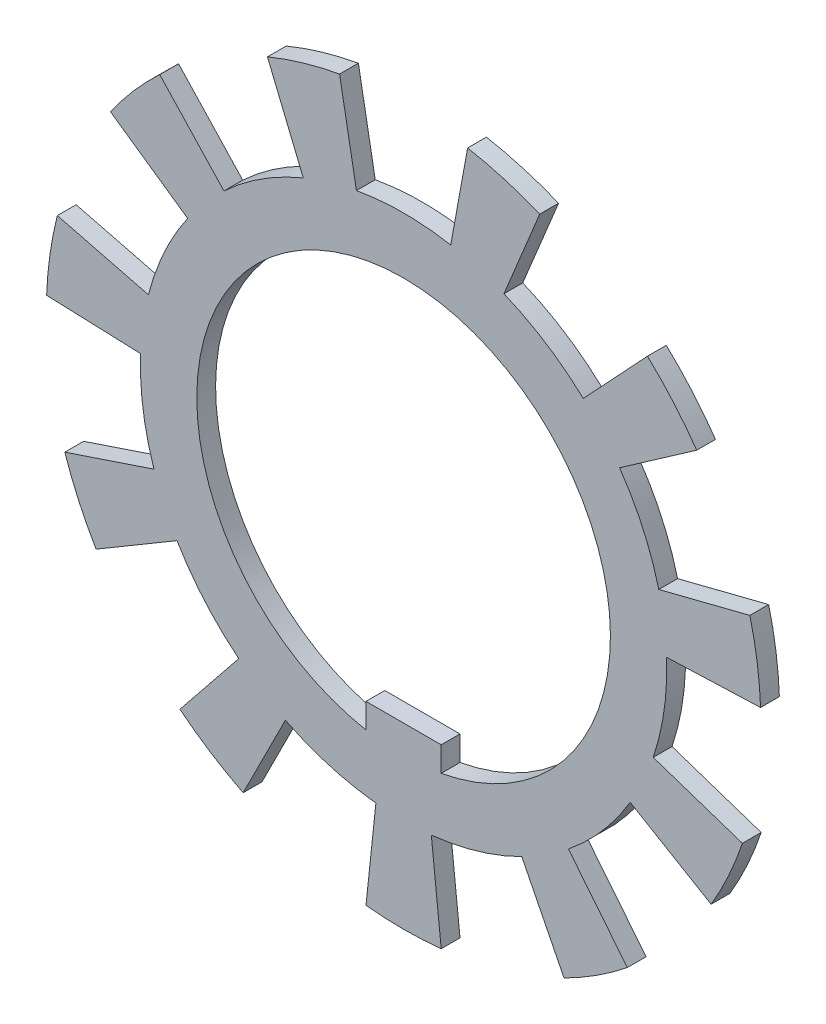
ISO-10303-21;
HEADER;
FILE_DESCRIPTION(('STEP AP214'),'2;1');
FILE_NAME('part.step','',(''),(''),'','','');
FILE_SCHEMA(('AUTOMOTIVE_DESIGN { 1 0 10303 214 1 1 1 1 }'));
ENDSEC;
DATA;
#1=APPLICATION_CONTEXT('core data for automotive mechanical design processes');
#2=APPLICATION_PROTOCOL_DEFINITION('international standard','automotive_design',2000,#1);
#3=PRODUCT_CONTEXT('',#1,'mechanical');
#4=PRODUCT('Part','Part','',(#3));
#5=PRODUCT_RELATED_PRODUCT_CATEGORY('part','',(#4));
#6=PRODUCT_DEFINITION_FORMATION('','',#4);
#7=PRODUCT_DEFINITION_CONTEXT('part definition',#1,'design');
#8=PRODUCT_DEFINITION('design','',#6,#7);
#9=PRODUCT_DEFINITION_SHAPE('','',#8);
#10=(LENGTH_UNIT() NAMED_UNIT(*) SI_UNIT(.MILLI.,.METRE.));
#11=(NAMED_UNIT(*) PLANE_ANGLE_UNIT() SI_UNIT($,.RADIAN.));
#12=(NAMED_UNIT(*) SI_UNIT($,.STERADIAN.) SOLID_ANGLE_UNIT());
#13=UNCERTAINTY_MEASURE_WITH_UNIT(LENGTH_MEASURE(1.E-05),#10,'distance_accuracy_value','');
#14=(GEOMETRIC_REPRESENTATION_CONTEXT(3) GLOBAL_UNCERTAINTY_ASSIGNED_CONTEXT((#13)) GLOBAL_UNIT_ASSIGNED_CONTEXT((#10,
#11,#12)) REPRESENTATION_CONTEXT('',''));
#15=CARTESIAN_POINT('',(0.,0.,0.));
#16=DIRECTION('',(0.,0.,1.));
#17=DIRECTION('',(1.,0.,0.));
#18=AXIS2_PLACEMENT_3D('',#15,#16,#17);
#19=CARTESIAN_POINT('',(0.,0.,0.));
#20=DIRECTION('',(0.,0.,1.));
#21=DIRECTION('',(1.,0.,0.));
#22=AXIS2_PLACEMENT_3D('',#19,#20,#21);
#23=CYLINDRICAL_SURFACE('',#22,19.);
#24=DIRECTION('',(0.,0.,1.));
#25=VECTOR('',#24,1.);
#26=CARTESIAN_POINT('',(-12.9697462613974,13.8847283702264,-1.));
#27=LINE('',#26,#25);
#28=CARTESIAN_POINT('',(-12.9697462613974,13.8847283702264,-1.));
#29=VERTEX_POINT('',#28);
#30=CARTESIAN_POINT('',(-12.9697462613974,13.8847283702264,0.));
#31=VERTEX_POINT('',#30);
#32=EDGE_CURVE('E398',#29,#31,#27,.T.);
#33=ORIENTED_EDGE('',*,*,#32,.F.);
#34=CARTESIAN_POINT('',(0.,0.,-1.));
#35=DIRECTION('',(0.,0.,1.));
#36=DIRECTION('',(1.,0.,0.));
#37=AXIS2_PLACEMENT_3D('',#34,#35,#36);
#38=CIRCLE('',#37,19.);
#39=CARTESIAN_POINT('',(-15.5891891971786,10.8617300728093,-1.));
#40=VERTEX_POINT('',#39);
#41=EDGE_CURVE('E682',#29,#40,#38,.T.);
#42=ORIENTED_EDGE('',*,*,#41,.T.);
#43=DIRECTION('',(0.,0.,1.));
#44=VECTOR('',#43,1.);
#45=CARTESIAN_POINT('',(-15.5891891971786,10.8617300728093,-1.));
#46=LINE('',#45,#44);
#47=CARTESIAN_POINT('',(-15.5891891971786,10.8617300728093,0.));
#48=VERTEX_POINT('',#47);
#49=EDGE_CURVE('E427',#40,#48,#46,.T.);
#50=ORIENTED_EDGE('',*,*,#49,.T.);
#51=CARTESIAN_POINT('',(0.,0.,0.));
#52=DIRECTION('',(0.,0.,1.));
#53=DIRECTION('',(1.,0.,0.));
#54=AXIS2_PLACEMENT_3D('',#51,#52,#53);
#55=CIRCLE('',#54,19.);
#56=EDGE_CURVE('E680',#31,#48,#55,.T.);
#57=ORIENTED_EDGE('',*,*,#56,.F.);
#58=EDGE_LOOP('',(#33,#42,#50,#57));
#59=FACE_BOUND('',#58,.T.);
#60=ADVANCED_FACE('F41',(#59),#23,.T.);
#61=DIRECTION('',(0.,0.,1.));
#62=VECTOR('',#61,1.);
#63=CARTESIAN_POINT('',(-18.4174957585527,4.66860257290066,-1.));
#64=LINE('',#63,#62);
#65=CARTESIAN_POINT('',(-18.4174957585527,4.66860257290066,-1.));
#66=VERTEX_POINT('',#65);
#67=CARTESIAN_POINT('',(-18.4174957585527,4.66860257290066,0.));
#68=VERTEX_POINT('',#67);
#69=EDGE_CURVE('E425',#66,#68,#64,.T.);
#70=ORIENTED_EDGE('',*,*,#69,.F.);
#71=CARTESIAN_POINT('',(-18.9867551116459,0.709316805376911,-1.));
#72=VERTEX_POINT('',#71);
#73=EDGE_CURVE('E686',#66,#72,#38,.T.);
#74=ORIENTED_EDGE('',*,*,#73,.T.);
#75=DIRECTION('',(0.,0.,1.));
#76=VECTOR('',#75,1.);
#77=CARTESIAN_POINT('',(-18.9867551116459,0.709316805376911,-1.));
#78=LINE('',#77,#76);
#79=CARTESIAN_POINT('',(-18.9867551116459,0.709316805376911,0.));
#80=VERTEX_POINT('',#79);
#81=EDGE_CURVE('E454',#72,#80,#78,.T.);
#82=ORIENTED_EDGE('',*,*,#81,.T.);
#83=EDGE_CURVE('E745',#68,#80,#55,.T.);
#84=ORIENTED_EDGE('',*,*,#83,.F.);
#85=EDGE_LOOP('',(#70,#74,#82,#84));
#86=FACE_BOUND('',#85,.T.);
#87=ADVANCED_FACE('F730',(#86),#23,.T.);
#88=DIRECTION('',(0.,0.,1.));
#89=VECTOR('',#88,1.);
#90=CARTESIAN_POINT('',(-18.017820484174,-6.02977155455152,-1.));
#91=LINE('',#90,#89);
#92=CARTESIAN_POINT('',(-18.017820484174,-6.02977155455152,-1.));
#93=VERTEX_POINT('',#92);
#94=CARTESIAN_POINT('',(-18.017820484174,-6.02977155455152,0.));
#95=VERTEX_POINT('',#94);
#96=EDGE_CURVE('E452',#93,#95,#91,.T.);
#97=ORIENTED_EDGE('',*,*,#96,.F.);
#98=CARTESIAN_POINT('',(-16.3561604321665,-9.66829953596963,-1.));
#99=VERTEX_POINT('',#98);
#100=EDGE_CURVE('E717',#93,#99,#38,.T.);
#101=ORIENTED_EDGE('',*,*,#100,.T.);
#102=DIRECTION('',(0.,0.,1.));
#103=VECTOR('',#102,1.);
#104=CARTESIAN_POINT('',(-16.3561604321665,-9.66829953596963,-1.));
#105=LINE('',#104,#103);
#106=CARTESIAN_POINT('',(-16.3561604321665,-9.66829953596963,0.));
#107=VERTEX_POINT('',#106);
#108=EDGE_CURVE('E481',#99,#107,#105,.T.);
#109=ORIENTED_EDGE('',*,*,#108,.T.);
#110=EDGE_CURVE('E747',#95,#107,#55,.T.);
#111=ORIENTED_EDGE('',*,*,#110,.F.);
#112=EDGE_LOOP('',(#97,#101,#109,#111));
#113=FACE_BOUND('',#112,.T.);
#114=ADVANCED_FACE('F800',(#113),#23,.T.);
#115=DIRECTION('',(0.,0.,1.));
#116=VECTOR('',#115,1.);
#117=CARTESIAN_POINT('',(-11.8976145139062,-14.8137358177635,-1.));
#118=LINE('',#117,#116);
#119=CARTESIAN_POINT('',(-11.8976145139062,-14.8137358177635,-1.));
#120=VERTEX_POINT('',#119);
#121=CARTESIAN_POINT('',(-11.8976145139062,-14.8137358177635,0.));
#122=VERTEX_POINT('',#121);
#123=EDGE_CURVE('E479',#120,#122,#118,.T.);
#124=ORIENTED_EDGE('',*,*,#123,.F.);
#125=CARTESIAN_POINT('',(-8.53260038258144,-16.9762990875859,-1.));
#126=VERTEX_POINT('',#125);
#127=EDGE_CURVE('E712',#120,#126,#38,.T.);
#128=ORIENTED_EDGE('',*,*,#127,.T.);
#129=DIRECTION('',(0.,0.,1.));
#130=VECTOR('',#129,1.);
#131=CARTESIAN_POINT('',(-8.53260038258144,-16.9762990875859,-1.));
#132=LINE('',#131,#130);
#133=CARTESIAN_POINT('',(-8.53260038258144,-16.9762990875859,0.));
#134=VERTEX_POINT('',#133);
#135=EDGE_CURVE('E508',#126,#134,#132,.T.);
#136=ORIENTED_EDGE('',*,*,#135,.T.);
#137=EDGE_CURVE('E748',#122,#134,#55,.T.);
#138=ORIENTED_EDGE('',*,*,#137,.F.);
#139=EDGE_LOOP('',(#124,#128,#136,#138));
#140=FACE_BOUND('',#139,.T.);
#141=ADVANCED_FACE('F1259',(#140),#23,.T.);
#142=DIRECTION('',(0.,0.,1.));
#143=VECTOR('',#142,1.);
#144=CARTESIAN_POINT('',(-2.00000000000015,-18.8944436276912,-1.));
#145=LINE('',#144,#143);
#146=CARTESIAN_POINT('',(-2.00000000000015,-18.8944436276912,-1.));
#147=VERTEX_POINT('',#146);
#148=CARTESIAN_POINT('',(-2.00000000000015,-18.8944436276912,0.));
#149=VERTEX_POINT('',#148);
#150=EDGE_CURVE('E506',#147,#149,#145,.T.);
#151=ORIENTED_EDGE('',*,*,#150,.F.);
#152=CARTESIAN_POINT('',(1.99999999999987,-18.8944436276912,-1.));
#153=VERTEX_POINT('',#152);
#154=EDGE_CURVE('E707',#147,#153,#38,.T.);
#155=ORIENTED_EDGE('',*,*,#154,.T.);
#156=DIRECTION('',(0.,0.,1.));
#157=VECTOR('',#156,1.);
#158=CARTESIAN_POINT('',(1.99999999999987,-18.8944436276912,-1.));
#159=LINE('',#158,#157);
#160=CARTESIAN_POINT('',(1.99999999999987,-18.8944436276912,0.));
#161=VERTEX_POINT('',#160);
#162=EDGE_CURVE('E535',#153,#161,#159,.T.);
#163=ORIENTED_EDGE('',*,*,#162,.T.);
#164=EDGE_CURVE('E751',#149,#161,#55,.T.);
#165=ORIENTED_EDGE('',*,*,#164,.F.);
#166=EDGE_LOOP('',(#151,#155,#163,#165));
#167=FACE_BOUND('',#166,.T.);
#168=ADVANCED_FACE('F1252',(#167),#23,.T.);
#169=DIRECTION('',(0.,0.,1.));
#170=VECTOR('',#169,1.);
#171=CARTESIAN_POINT('',(8.53260038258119,-16.9762990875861,-1.));
#172=LINE('',#171,#170);
#173=CARTESIAN_POINT('',(8.53260038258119,-16.9762990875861,-1.));
#174=VERTEX_POINT('',#173);
#175=CARTESIAN_POINT('',(8.53260038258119,-16.9762990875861,0.));
#176=VERTEX_POINT('',#175);
#177=EDGE_CURVE('E533',#174,#176,#172,.T.);
#178=ORIENTED_EDGE('',*,*,#177,.F.);
#179=CARTESIAN_POINT('',(11.8976145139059,-14.8137358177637,-1.));
#180=VERTEX_POINT('',#179);
#181=EDGE_CURVE('E702',#174,#180,#38,.T.);
#182=ORIENTED_EDGE('',*,*,#181,.T.);
#183=DIRECTION('',(0.,0.,1.));
#184=VECTOR('',#183,1.);
#185=CARTESIAN_POINT('',(11.8976145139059,-14.8137358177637,-1.));
#186=LINE('',#185,#184);
#187=CARTESIAN_POINT('',(11.8976145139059,-14.8137358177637,0.));
#188=VERTEX_POINT('',#187);
#189=EDGE_CURVE('E562',#180,#188,#186,.T.);
#190=ORIENTED_EDGE('',*,*,#189,.T.);
#191=EDGE_CURVE('E755',#176,#188,#55,.T.);
#192=ORIENTED_EDGE('',*,*,#191,.F.);
#193=EDGE_LOOP('',(#178,#182,#190,#192));
#194=FACE_BOUND('',#193,.T.);
#195=ADVANCED_FACE('F1245',(#194),#23,.T.);
#196=DIRECTION('',(0.,0.,1.));
#197=VECTOR('',#196,1.);
#198=CARTESIAN_POINT('',(16.3561604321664,-9.66829953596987,-1.));
#199=LINE('',#198,#197);
#200=CARTESIAN_POINT('',(16.3561604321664,-9.66829953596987,-1.));
#201=VERTEX_POINT('',#200);
#202=CARTESIAN_POINT('',(16.3561604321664,-9.66829953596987,0.));
#203=VERTEX_POINT('',#202);
#204=EDGE_CURVE('E560',#201,#203,#199,.T.);
#205=ORIENTED_EDGE('',*,*,#204,.F.);
#206=CARTESIAN_POINT('',(18.0178204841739,-6.02977155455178,-1.));
#207=VERTEX_POINT('',#206);
#208=EDGE_CURVE('E697',#201,#207,#38,.T.);
#209=ORIENTED_EDGE('',*,*,#208,.T.);
#210=DIRECTION('',(0.,0.,1.));
#211=VECTOR('',#210,1.);
#212=CARTESIAN_POINT('',(18.0178204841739,-6.02977155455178,-1.));
#213=LINE('',#212,#211);
#214=CARTESIAN_POINT('',(18.0178204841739,-6.02977155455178,0.));
#215=VERTEX_POINT('',#214);
#216=EDGE_CURVE('E589',#207,#215,#213,.T.);
#217=ORIENTED_EDGE('',*,*,#216,.T.);
#218=EDGE_CURVE('E759',#203,#215,#55,.T.);
#219=ORIENTED_EDGE('',*,*,#218,.F.);
#220=EDGE_LOOP('',(#205,#209,#217,#219));
#221=FACE_BOUND('',#220,.T.);
#222=ADVANCED_FACE('F1238',(#221),#23,.T.);
#223=DIRECTION('',(0.,0.,1.));
#224=VECTOR('',#223,1.);
#225=CARTESIAN_POINT('',(18.9867551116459,0.709316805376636,-1.));
#226=LINE('',#225,#224);
#227=CARTESIAN_POINT('',(18.9867551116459,0.709316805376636,-1.));
#228=VERTEX_POINT('',#227);
#229=CARTESIAN_POINT('',(18.9867551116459,0.709316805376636,0.));
#230=VERTEX_POINT('',#229);
#231=EDGE_CURVE('E587',#228,#230,#226,.T.);
#232=ORIENTED_EDGE('',*,*,#231,.F.);
#233=CARTESIAN_POINT('',(18.4174957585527,4.66860257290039,-1.));
#234=VERTEX_POINT('',#233);
#235=EDGE_CURVE('E692',#228,#234,#38,.T.);
#236=ORIENTED_EDGE('',*,*,#235,.T.);
#237=DIRECTION('',(0.,0.,1.));
#238=VECTOR('',#237,1.);
#239=CARTESIAN_POINT('',(18.4174957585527,4.66860257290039,-1.));
#240=LINE('',#239,#238);
#241=CARTESIAN_POINT('',(18.4174957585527,4.66860257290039,0.));
#242=VERTEX_POINT('',#241);
#243=EDGE_CURVE('E616',#234,#242,#240,.T.);
#244=ORIENTED_EDGE('',*,*,#243,.T.);
#245=EDGE_CURVE('E763',#230,#242,#55,.T.);
#246=ORIENTED_EDGE('',*,*,#245,.F.);
#247=EDGE_LOOP('',(#232,#236,#244,#246));
#248=FACE_BOUND('',#247,.T.);
#249=ADVANCED_FACE('F792',(#248),#23,.T.);
#250=DIRECTION('',(0.,0.,1.));
#251=VECTOR('',#250,1.);
#252=CARTESIAN_POINT('',(15.5891891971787,10.8617300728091,-1.));
#253=LINE('',#252,#251);
#254=CARTESIAN_POINT('',(15.5891891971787,10.8617300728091,-1.));
#255=VERTEX_POINT('',#254);
#256=CARTESIAN_POINT('',(15.5891891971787,10.8617300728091,0.));
#257=VERTEX_POINT('',#256);
#258=EDGE_CURVE('E614',#255,#257,#253,.T.);
#259=ORIENTED_EDGE('',*,*,#258,.F.);
#260=CARTESIAN_POINT('',(12.9697462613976,13.8847283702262,-1.));
#261=VERTEX_POINT('',#260);
#262=EDGE_CURVE('E687',#255,#261,#38,.T.);
#263=ORIENTED_EDGE('',*,*,#262,.T.);
#264=DIRECTION('',(0.,0.,1.));
#265=VECTOR('',#264,1.);
#266=CARTESIAN_POINT('',(12.9697462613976,13.8847283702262,-1.));
#267=LINE('',#266,#265);
#268=CARTESIAN_POINT('',(12.9697462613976,13.8847283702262,0.));
#269=VERTEX_POINT('',#268);
#270=EDGE_CURVE('E643',#261,#269,#267,.T.);
#271=ORIENTED_EDGE('',*,*,#270,.T.);
#272=EDGE_CURVE('E767',#257,#269,#55,.T.);
#273=ORIENTED_EDGE('',*,*,#272,.F.);
#274=EDGE_LOOP('',(#259,#263,#271,#273));
#275=FACE_BOUND('',#274,.T.);
#276=ADVANCED_FACE('F784',(#275),#23,.T.);
#277=DIRECTION('',(0.,0.,1.));
#278=VECTOR('',#277,1.);
#279=CARTESIAN_POINT('',(7.24216586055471,17.565620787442,-1.));
#280=LINE('',#279,#278);
#281=CARTESIAN_POINT('',(7.24216586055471,17.565620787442,-1.));
#282=VERTEX_POINT('',#281);
#283=CARTESIAN_POINT('',(7.24216586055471,17.565620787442,0.));
#284=VERTEX_POINT('',#283);
#285=EDGE_CURVE('E641',#282,#284,#280,.T.);
#286=ORIENTED_EDGE('',*,*,#285,.F.);
#287=CARTESIAN_POINT('',(3.4041939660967,18.6925510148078,-1.));
#288=VERTEX_POINT('',#287);
#289=EDGE_CURVE('E679',#282,#288,#38,.T.);
#290=ORIENTED_EDGE('',*,*,#289,.T.);
#291=DIRECTION('',(0.,0.,1.));
#292=VECTOR('',#291,1.);
#293=CARTESIAN_POINT('',(3.4041939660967,18.6925510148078,-1.));
#294=LINE('',#293,#292);
#295=CARTESIAN_POINT('',(3.4041939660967,18.6925510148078,0.));
#296=VERTEX_POINT('',#295);
#297=EDGE_CURVE('E670',#288,#296,#294,.T.);
#298=ORIENTED_EDGE('',*,*,#297,.T.);
#299=EDGE_CURVE('E676',#284,#296,#55,.T.);
#300=ORIENTED_EDGE('',*,*,#299,.F.);
#301=EDGE_LOOP('',(#286,#290,#298,#300));
#302=FACE_BOUND('',#301,.T.);
#303=ADVANCED_FACE('F782',(#302),#23,.T.);
#304=CARTESIAN_POINT('',(0.,0.,0.));
#305=DIRECTION('',(0.,0.,1.));
#306=DIRECTION('',(1.,0.,0.));
#307=AXIS2_PLACEMENT_3D('',#304,#305,#306);
#308=CYLINDRICAL_SURFACE('',#307,11.);
#309=DIRECTION('',(0.,0.,1.));
#310=VECTOR('',#309,1.);
#311=CARTESIAN_POINT('',(2.,-10.816653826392,0.));
#312=LINE('',#311,#310);
#313=CARTESIAN_POINT('',(2.,-10.816653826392,0.));
#314=VERTEX_POINT('',#313);
#315=CARTESIAN_POINT('',(2.,-10.816653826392,-1.));
#316=VERTEX_POINT('',#315);
#317=EDGE_CURVE('E376',#314,#316,#312,.F.);
#318=ORIENTED_EDGE('',*,*,#317,.F.);
#319=CARTESIAN_POINT('',(0.,0.,0.));
#320=DIRECTION('',(0.,0.,1.));
#321=DIRECTION('',(1.,0.,0.));
#322=AXIS2_PLACEMENT_3D('',#319,#320,#321);
#323=CIRCLE('',#322,11.);
#324=CARTESIAN_POINT('',(-2.,-10.816653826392,0.));
#325=VERTEX_POINT('',#324);
#326=EDGE_CURVE('E667',#314,#325,#323,.T.);
#327=ORIENTED_EDGE('',*,*,#326,.T.);
#328=DIRECTION('',(0.,0.,1.));
#329=VECTOR('',#328,1.);
#330=CARTESIAN_POINT('',(-2.,-10.816653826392,0.));
#331=LINE('',#330,#329);
#332=CARTESIAN_POINT('',(-2.,-10.816653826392,-1.));
#333=VERTEX_POINT('',#332);
#334=EDGE_CURVE('E59',#333,#325,#331,.T.);
#335=ORIENTED_EDGE('',*,*,#334,.F.);
#336=CARTESIAN_POINT('',(0.,0.,-1.));
#337=DIRECTION('',(0.,0.,1.));
#338=DIRECTION('',(1.,0.,0.));
#339=AXIS2_PLACEMENT_3D('',#336,#337,#338);
#340=CIRCLE('',#339,11.);
#341=EDGE_CURVE('E11',#316,#333,#340,.T.);
#342=ORIENTED_EDGE('',*,*,#341,.F.);
#343=EDGE_LOOP('',(#318,#327,#335,#342));
#344=FACE_BOUND('',#343,.T.);
#345=ADVANCED_FACE('F43',(#344),#308,.F.);
#346=CARTESIAN_POINT('',(11.,0.,-1.));
#347=DIRECTION('',(0.,0.,-1.));
#348=DIRECTION('',(-1.,0.,0.));
#349=AXIS2_PLACEMENT_3D('',#346,#347,#348);
#350=PLANE('',#349);
#351=ORIENTED_EDGE('',*,*,#341,.T.);
#352=DIRECTION('',(0.,-1.,0.));
#353=VECTOR('',#352,1.);
#354=CARTESIAN_POINT('',(-2.,-9.5,-1.));
#355=LINE('',#354,#353);
#356=CARTESIAN_POINT('',(-2.,-9.5,-1.));
#357=VERTEX_POINT('',#356);
#358=EDGE_CURVE('E353',#357,#333,#355,.T.);
#359=ORIENTED_EDGE('',*,*,#358,.F.);
#360=DIRECTION('',(-1.,0.,0.));
#361=VECTOR('',#360,1.);
#362=CARTESIAN_POINT('',(-2.,-9.5,-1.));
#363=LINE('',#362,#361);
#364=CARTESIAN_POINT('',(2.,-9.5,-1.));
#365=VERTEX_POINT('',#364);
#366=EDGE_CURVE('E350',#365,#357,#363,.T.);
#367=ORIENTED_EDGE('',*,*,#366,.F.);
#368=DIRECTION('',(0.,1.,0.));
#369=VECTOR('',#368,1.);
#370=CARTESIAN_POINT('',(2.,-9.5,-1.));
#371=LINE('',#370,#369);
#372=EDGE_CURVE('E366',#316,#365,#371,.T.);
#373=ORIENTED_EDGE('',*,*,#372,.F.);
#374=EDGE_LOOP('',(#351,#359,#367,#373));
#375=FACE_BOUND('',#374,.T.);
#376=DIRECTION('',(0.682618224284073,-0.730775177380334,0.));
#377=VECTOR('',#376,1.);
#378=CARTESIAN_POINT('',(-9.55665513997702,10.2308524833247,-1.));
#379=LINE('',#378,#377);
#380=CARTESIAN_POINT('',(-9.55665513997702,10.2308524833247,-1.));
#381=VERTEX_POINT('',#380);
#382=EDGE_CURVE('E386',#29,#381,#379,.T.);
#383=ORIENTED_EDGE('',*,*,#382,.T.);
#384=CARTESIAN_POINT('',(0.,0.,-1.));
#385=DIRECTION('',(0.,0.,-1.));
#386=DIRECTION('',(-0.841253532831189,-0.540640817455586,0.));
#387=AXIS2_PLACEMENT_3D('',#384,#385,#386);
#388=CIRCLE('',#387,14.);
#389=CARTESIAN_POINT('',(-5.33633273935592,12.9430890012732,-1.));
#390=VERTEX_POINT('',#389);
#391=EDGE_CURVE('E379',#381,#390,#388,.T.);
#392=ORIENTED_EDGE('',*,*,#391,.T.);
#393=DIRECTION('',(-0.381166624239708,0.924506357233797,0.));
#394=VECTOR('',#393,1.);
#395=CARTESIAN_POINT('',(-5.33633273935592,12.9430890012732,-1.));
#396=LINE('',#395,#394);
#397=CARTESIAN_POINT('',(-7.24216586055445,17.5656207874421,-1.));
#398=VERTEX_POINT('',#397);
#399=EDGE_CURVE('E382',#390,#398,#396,.T.);
#400=ORIENTED_EDGE('',*,*,#399,.T.);
#401=CARTESIAN_POINT('',(-3.4041939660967,18.6925510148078,-1.));
#402=VERTEX_POINT('',#401);
#403=EDGE_CURVE('E49',#402,#398,#38,.T.);
#404=ORIENTED_EDGE('',*,*,#403,.F.);
#405=DIRECTION('',(0.179168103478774,-0.983818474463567,0.));
#406=VECTOR('',#405,1.);
#407=CARTESIAN_POINT('',(-2.50835344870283,13.7734586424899,-1.));
#408=LINE('',#407,#406);
#409=CARTESIAN_POINT('',(-2.50835344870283,13.7734586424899,-1.));
#410=VERTEX_POINT('',#409);
#411=EDGE_CURVE('E655',#402,#410,#408,.T.);
#412=ORIENTED_EDGE('',*,*,#411,.T.);
#413=CARTESIAN_POINT('',(0.,0.,-1.));
#414=DIRECTION('',(0.,0.,-1.));
#415=DIRECTION('',(-1.,0.,0.));
#416=AXIS2_PLACEMENT_3D('',#413,#414,#415);
#417=CIRCLE('',#416,14.);
#418=CARTESIAN_POINT('',(2.50835344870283,13.7734586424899,-1.));
#419=VERTEX_POINT('',#418);
#420=EDGE_CURVE('E648',#410,#419,#417,.T.);
#421=ORIENTED_EDGE('',*,*,#420,.T.);
#422=DIRECTION('',(0.179168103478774,0.983818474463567,0.));
#423=VECTOR('',#422,1.);
#424=CARTESIAN_POINT('',(2.50835344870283,13.7734586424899,-1.));
#425=LINE('',#424,#423);
#426=EDGE_CURVE('E651',#419,#288,#425,.T.);
#427=ORIENTED_EDGE('',*,*,#426,.T.);
#428=ORIENTED_EDGE('',*,*,#289,.F.);
#429=DIRECTION('',(-0.381166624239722,-0.924506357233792,0.));
#430=VECTOR('',#429,1.);
#431=CARTESIAN_POINT('',(5.33633273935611,12.9430890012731,-1.));
#432=LINE('',#431,#430);
#433=CARTESIAN_POINT('',(5.33633273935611,12.9430890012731,-1.));
#434=VERTEX_POINT('',#433);
#435=EDGE_CURVE('E628',#282,#434,#432,.T.);
#436=ORIENTED_EDGE('',*,*,#435,.T.);
#437=CARTESIAN_POINT('',(0.,0.,-1.));
#438=DIRECTION('',(0.,0.,-1.));
#439=DIRECTION('',(-0.841253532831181,0.540640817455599,0.));
#440=AXIS2_PLACEMENT_3D('',#437,#438,#439);
#441=CIRCLE('',#440,14.);
#442=CARTESIAN_POINT('',(9.55665513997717,10.2308524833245,-1.));
#443=VERTEX_POINT('',#442);
#444=EDGE_CURVE('E621',#434,#443,#441,.T.);
#445=ORIENTED_EDGE('',*,*,#444,.T.);
#446=DIRECTION('',(0.682618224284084,0.730775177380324,0.));
#447=VECTOR('',#446,1.);
#448=CARTESIAN_POINT('',(9.55665513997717,10.2308524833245,-1.));
#449=LINE('',#448,#447);
#450=EDGE_CURVE('E624',#443,#261,#449,.T.);
#451=ORIENTED_EDGE('',*,*,#450,.T.);
#452=ORIENTED_EDGE('',*,*,#262,.F.);
#453=DIRECTION('',(-0.820483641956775,-0.571670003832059,0.));
#454=VECTOR('',#453,1.);
#455=CARTESIAN_POINT('',(11.4867709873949,8.00338005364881,-1.));
#456=LINE('',#455,#454);
#457=CARTESIAN_POINT('',(11.4867709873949,8.00338005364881,-1.));
#458=VERTEX_POINT('',#457);
#459=EDGE_CURVE('E601',#255,#458,#456,.T.);
#460=ORIENTED_EDGE('',*,*,#459,.T.);
#461=CARTESIAN_POINT('',(0.,0.,-1.));
#462=DIRECTION('',(0.,0.,-1.));
#463=DIRECTION('',(-0.415415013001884,0.909631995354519,0.));
#464=AXIS2_PLACEMENT_3D('',#461,#462,#463);
#465=CIRCLE('',#464,14.);
#466=CARTESIAN_POINT('',(13.5707863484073,3.44002294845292,-1.));
#467=VERTEX_POINT('',#466);
#468=EDGE_CURVE('E594',#458,#467,#465,.T.);
#469=ORIENTED_EDGE('',*,*,#468,.T.);
#470=DIRECTION('',(0.969341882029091,0.245715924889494,0.));
#471=VECTOR('',#470,1.);
#472=CARTESIAN_POINT('',(13.5707863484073,3.44002294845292,-1.));
#473=LINE('',#472,#471);
#474=EDGE_CURVE('E597',#467,#234,#473,.T.);
#475=ORIENTED_EDGE('',*,*,#474,.T.);
#476=ORIENTED_EDGE('',*,*,#235,.F.);
#477=DIRECTION('',(-0.99930290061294,-0.0373324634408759,0.));
#478=VECTOR('',#477,1.);
#479=CARTESIAN_POINT('',(13.9902406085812,0.522654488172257,-1.));
#480=LINE('',#479,#478);
#481=CARTESIAN_POINT('',(13.9902406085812,0.522654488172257,-1.));
#482=VERTEX_POINT('',#481);
#483=EDGE_CURVE('E574',#228,#482,#480,.T.);
#484=ORIENTED_EDGE('',*,*,#483,.T.);
#485=CARTESIAN_POINT('',(0.,0.,-1.));
#486=DIRECTION('',(0.,0.,-1.));
#487=DIRECTION('',(0.142314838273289,0.989821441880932,0.));
#488=AXIS2_PLACEMENT_3D('',#485,#486,#487);
#489=CIRCLE('',#488,14.);
#490=CARTESIAN_POINT('',(13.2762887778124,-4.44298956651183,-1.));
#491=VERTEX_POINT('',#490);
#492=EDGE_CURVE('E567',#482,#491,#489,.T.);
#493=ORIENTED_EDGE('',*,*,#492,.T.);
#494=DIRECTION('',(0.948306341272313,-0.317356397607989,0.));
#495=VECTOR('',#494,1.);
#496=CARTESIAN_POINT('',(13.2762887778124,-4.44298956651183,-1.));
#497=LINE('',#496,#495);
#498=EDGE_CURVE('E570',#491,#207,#497,.T.);
#499=ORIENTED_EDGE('',*,*,#498,.T.);
#500=ORIENTED_EDGE('',*,*,#208,.F.);
#501=DIRECTION('',(-0.860850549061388,0.508857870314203,0.));
#502=VECTOR('',#501,1.);
#503=CARTESIAN_POINT('',(12.0519076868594,-7.12401018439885,-1.));
#504=LINE('',#503,#502);
#505=CARTESIAN_POINT('',(12.0519076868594,-7.12401018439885,-1.));
#506=VERTEX_POINT('',#505);
#507=EDGE_CURVE('E547',#201,#506,#504,.T.);
#508=ORIENTED_EDGE('',*,*,#507,.T.);
#509=CARTESIAN_POINT('',(0.,0.,-1.));
#510=DIRECTION('',(0.,0.,-1.));
#511=DIRECTION('',(0.654860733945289,0.755749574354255,0.));
#512=AXIS2_PLACEMENT_3D('',#509,#510,#511);
#513=CIRCLE('',#512,14.);
#514=CARTESIAN_POINT('',(8.76666332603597,-10.9153842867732,-1.));
#515=VERTEX_POINT('',#514);
#516=EDGE_CURVE('E540',#506,#515,#513,.T.);
#517=ORIENTED_EDGE('',*,*,#516,.T.);
#518=DIRECTION('',(0.626190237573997,-0.779670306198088,0.));
#519=VECTOR('',#518,1.);
#520=CARTESIAN_POINT('',(8.76666332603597,-10.9153842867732,-1.));
#521=LINE('',#520,#519);
#522=EDGE_CURVE('E543',#515,#180,#521,.T.);
#523=ORIENTED_EDGE('',*,*,#522,.T.);
#524=ORIENTED_EDGE('',*,*,#181,.F.);
#525=DIRECTION('',(-0.449084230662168,0.893489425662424,0.));
#526=VECTOR('',#525,1.);
#527=CARTESIAN_POINT('',(6.28717922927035,-12.5088519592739,-1.));
#528=LINE('',#527,#526);
#529=CARTESIAN_POINT('',(6.28717922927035,-12.5088519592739,-1.));
#530=VERTEX_POINT('',#529);
#531=EDGE_CURVE('E520',#174,#530,#528,.T.);
#532=ORIENTED_EDGE('',*,*,#531,.T.);
#533=CARTESIAN_POINT('',(0.,0.,-1.));
#534=DIRECTION('',(0.,0.,-1.));
#535=DIRECTION('',(0.959492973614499,0.281732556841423,0.));
#536=AXIS2_PLACEMENT_3D('',#533,#534,#535);
#537=CIRCLE('',#536,14.);
#538=CARTESIAN_POINT('',(1.47368421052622,-13.922221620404,-1.));
#539=VERTEX_POINT('',#538);
#540=EDGE_CURVE('E513',#530,#539,#537,.T.);
#541=ORIENTED_EDGE('',*,*,#540,.T.);
#542=DIRECTION('',(0.10526315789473,-0.994444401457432,0.));
#543=VECTOR('',#542,1.);
#544=CARTESIAN_POINT('',(1.47368421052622,-13.922221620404,-1.));
#545=LINE('',#544,#543);
#546=EDGE_CURVE('E516',#539,#153,#545,.T.);
#547=ORIENTED_EDGE('',*,*,#546,.T.);
#548=ORIENTED_EDGE('',*,*,#154,.F.);
#549=DIRECTION('',(0.105263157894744,0.99444440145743,0.));
#550=VECTOR('',#549,1.);
#551=CARTESIAN_POINT('',(-1.47368421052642,-13.922221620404,-1.));
#552=LINE('',#551,#550);
#553=CARTESIAN_POINT('',(-1.47368421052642,-13.922221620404,-1.));
#554=VERTEX_POINT('',#553);
#555=EDGE_CURVE('E493',#147,#554,#552,.T.);
#556=ORIENTED_EDGE('',*,*,#555,.T.);
#557=CARTESIAN_POINT('',(0.,0.,-1.));
#558=DIRECTION('',(0.,0.,-1.));
#559=DIRECTION('',(0.959492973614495,-0.281732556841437,0.));
#560=AXIS2_PLACEMENT_3D('',#557,#558,#559);
#561=CIRCLE('',#560,14.);
#562=CARTESIAN_POINT('',(-6.28717922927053,-12.5088519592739,-1.));
#563=VERTEX_POINT('',#562);
#564=EDGE_CURVE('E486',#554,#563,#561,.T.);
#565=ORIENTED_EDGE('',*,*,#564,.T.);
#566=DIRECTION('',(-0.449084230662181,-0.893489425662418,0.));
#567=VECTOR('',#566,1.);
#568=CARTESIAN_POINT('',(-6.28717922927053,-12.5088519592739,-1.));
#569=LINE('',#568,#567);
#570=EDGE_CURVE('E489',#563,#126,#569,.T.);
#571=ORIENTED_EDGE('',*,*,#570,.T.);
#572=ORIENTED_EDGE('',*,*,#127,.F.);
#573=DIRECTION('',(0.626190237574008,0.779670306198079,0.));
#574=VECTOR('',#573,1.);
#575=CARTESIAN_POINT('',(-8.76666332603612,-10.9153842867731,-1.));
#576=LINE('',#575,#574);
#577=CARTESIAN_POINT('',(-8.76666332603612,-10.9153842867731,-1.));
#578=VERTEX_POINT('',#577);
#579=EDGE_CURVE('E466',#120,#578,#576,.T.);
#580=ORIENTED_EDGE('',*,*,#579,.T.);
#581=CARTESIAN_POINT('',(0.,0.,-1.));
#582=DIRECTION('',(0.,0.,-1.));
#583=DIRECTION('',(0.654860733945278,-0.755749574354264,0.));
#584=AXIS2_PLACEMENT_3D('',#581,#582,#583);
#585=CIRCLE('',#584,14.);
#586=CARTESIAN_POINT('',(-12.0519076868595,-7.12401018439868,-1.));
#587=VERTEX_POINT('',#586);
#588=EDGE_CURVE('E459',#578,#587,#585,.T.);
#589=ORIENTED_EDGE('',*,*,#588,.T.);
#590=DIRECTION('',(-0.860850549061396,-0.508857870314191,0.));
#591=VECTOR('',#590,1.);
#592=CARTESIAN_POINT('',(-12.0519076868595,-7.12401018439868,-1.));
#593=LINE('',#592,#591);
#594=EDGE_CURVE('E462',#587,#99,#593,.T.);
#595=ORIENTED_EDGE('',*,*,#594,.T.);
#596=ORIENTED_EDGE('',*,*,#100,.F.);
#597=DIRECTION('',(0.948306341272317,0.317356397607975,0.));
#598=VECTOR('',#597,1.);
#599=CARTESIAN_POINT('',(-13.2762887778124,-4.44298956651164,-1.));
#600=LINE('',#599,#598);
#601=CARTESIAN_POINT('',(-13.2762887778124,-4.44298956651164,-1.));
#602=VERTEX_POINT('',#601);
#603=EDGE_CURVE('E439',#93,#602,#600,.T.);
#604=ORIENTED_EDGE('',*,*,#603,.T.);
#605=CARTESIAN_POINT('',(0.,0.,-1.));
#606=DIRECTION('',(0.,0.,-1.));
#607=DIRECTION('',(0.142314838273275,-0.989821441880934,0.));
#608=AXIS2_PLACEMENT_3D('',#605,#606,#607);
#609=CIRCLE('',#608,14.);
#610=CARTESIAN_POINT('',(-13.9902406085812,0.522654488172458,-1.));
#611=VERTEX_POINT('',#610);
#612=EDGE_CURVE('E432',#602,#611,#609,.T.);
#613=ORIENTED_EDGE('',*,*,#612,.T.);
#614=DIRECTION('',(-0.99930290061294,0.0373324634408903,0.));
#615=VECTOR('',#614,1.);
#616=CARTESIAN_POINT('',(-13.9902406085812,0.522654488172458,-1.));
#617=LINE('',#616,#615);
#618=EDGE_CURVE('E435',#611,#72,#617,.T.);
#619=ORIENTED_EDGE('',*,*,#618,.T.);
#620=ORIENTED_EDGE('',*,*,#73,.F.);
#621=DIRECTION('',(0.969341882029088,-0.245715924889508,0.));
#622=VECTOR('',#621,1.);
#623=CARTESIAN_POINT('',(-13.5707863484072,3.44002294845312,-1.));
#624=LINE('',#623,#622);
#625=CARTESIAN_POINT('',(-13.5707863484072,3.44002294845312,-1.));
#626=VERTEX_POINT('',#625);
#627=EDGE_CURVE('E412',#66,#626,#624,.T.);
#628=ORIENTED_EDGE('',*,*,#627,.T.);
#629=CARTESIAN_POINT('',(0.,0.,-1.));
#630=DIRECTION('',(0.,0.,-1.));
#631=DIRECTION('',(-0.415415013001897,-0.909631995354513,0.));
#632=AXIS2_PLACEMENT_3D('',#629,#630,#631);
#633=CIRCLE('',#632,14.);
#634=CARTESIAN_POINT('',(-11.4867709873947,8.00338005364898,-1.));
#635=VERTEX_POINT('',#634);
#636=EDGE_CURVE('E405',#626,#635,#633,.T.);
#637=ORIENTED_EDGE('',*,*,#636,.T.);
#638=DIRECTION('',(-0.820483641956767,0.57167000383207,0.));
#639=VECTOR('',#638,1.);
#640=CARTESIAN_POINT('',(-11.4867709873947,8.00338005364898,-1.));
#641=LINE('',#640,#639);
#642=EDGE_CURVE('E408',#635,#40,#641,.T.);
#643=ORIENTED_EDGE('',*,*,#642,.T.);
#644=ORIENTED_EDGE('',*,*,#41,.F.);
#645=EDGE_LOOP('',(#383,#392,#400,#404,#412,#421,#427,#428,#436,#445,#451,#452,#460,#469,#475,
#476,#484,#493,#499,#500,#508,#517,#523,#524,#532,#541,#547,#548,#556,#565,#571,#572,#580,#589,
#595,#596,#604,#613,#619,#620,#628,#637,#643,#644));
#646=FACE_BOUND('',#645,.T.);
#647=ADVANCED_FACE('F737',(#375,#646),#350,.T.);
#648=DIRECTION('',(0.,0.,1.));
#649=VECTOR('',#648,1.);
#650=CARTESIAN_POINT('',(-7.24216586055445,17.5656207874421,-1.));
#651=LINE('',#650,#649);
#652=CARTESIAN_POINT('',(-7.24216586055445,17.5656207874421,0.));
#653=VERTEX_POINT('',#652);
#654=EDGE_CURVE('E400',#398,#653,#651,.T.);
#655=ORIENTED_EDGE('',*,*,#654,.T.);
#656=CARTESIAN_POINT('',(-3.4041939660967,18.6925510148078,0.));
#657=VERTEX_POINT('',#656);
#658=EDGE_CURVE('E677',#657,#653,#55,.T.);
#659=ORIENTED_EDGE('',*,*,#658,.F.);
#660=DIRECTION('',(0.,0.,1.));
#661=VECTOR('',#660,1.);
#662=CARTESIAN_POINT('',(-3.4041939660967,18.6925510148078,-1.));
#663=LINE('',#662,#661);
#664=EDGE_CURVE('E668',#402,#657,#663,.T.);
#665=ORIENTED_EDGE('',*,*,#664,.F.);
#666=ORIENTED_EDGE('',*,*,#403,.T.);
#667=EDGE_LOOP('',(#655,#659,#665,#666));
#668=FACE_BOUND('',#667,.T.);
#669=ADVANCED_FACE('F786',(#668),#23,.T.);
#670=CARTESIAN_POINT('',(11.,0.,0.));
#671=DIRECTION('',(0.,0.,1.));
#672=DIRECTION('',(1.,0.,0.));
#673=AXIS2_PLACEMENT_3D('',#670,#671,#672);
#674=PLANE('',#673);
#675=ORIENTED_EDGE('',*,*,#326,.F.);
#676=DIRECTION('',(0.,1.,0.));
#677=VECTOR('',#676,1.);
#678=CARTESIAN_POINT('',(2.,-9.5,0.));
#679=LINE('',#678,#677);
#680=CARTESIAN_POINT('',(2.,-9.5,0.));
#681=VERTEX_POINT('',#680);
#682=EDGE_CURVE('E360',#314,#681,#679,.T.);
#683=ORIENTED_EDGE('',*,*,#682,.T.);
#684=DIRECTION('',(-1.,0.,0.));
#685=VECTOR('',#684,1.);
#686=CARTESIAN_POINT('',(-2.,-9.5,0.));
#687=LINE('',#686,#685);
#688=CARTESIAN_POINT('',(-2.,-9.5,0.));
#689=VERTEX_POINT('',#688);
#690=EDGE_CURVE('E348',#681,#689,#687,.T.);
#691=ORIENTED_EDGE('',*,*,#690,.T.);
#692=DIRECTION('',(0.,-1.,0.));
#693=VECTOR('',#692,1.);
#694=CARTESIAN_POINT('',(-2.,-9.5,0.));
#695=LINE('',#694,#693);
#696=EDGE_CURVE('E356',#689,#325,#695,.T.);
#697=ORIENTED_EDGE('',*,*,#696,.T.);
#698=EDGE_LOOP('',(#675,#683,#691,#697));
#699=FACE_BOUND('',#698,.T.);
#700=DIRECTION('',(0.682618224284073,-0.730775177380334,0.));
#701=VECTOR('',#700,1.);
#702=CARTESIAN_POINT('',(-9.55665513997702,10.2308524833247,0.));
#703=LINE('',#702,#701);
#704=CARTESIAN_POINT('',(-9.55665513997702,10.2308524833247,0.));
#705=VERTEX_POINT('',#704);
#706=EDGE_CURVE('E383',#31,#705,#703,.T.);
#707=ORIENTED_EDGE('',*,*,#706,.F.);
#708=ORIENTED_EDGE('',*,*,#56,.T.);
#709=DIRECTION('',(-0.820483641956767,0.57167000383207,0.));
#710=VECTOR('',#709,1.);
#711=CARTESIAN_POINT('',(-11.4867709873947,8.00338005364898,0.));
#712=LINE('',#711,#710);
#713=CARTESIAN_POINT('',(-11.4867709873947,8.00338005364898,0.));
#714=VERTEX_POINT('',#713);
#715=EDGE_CURVE('E417',#714,#48,#712,.T.);
#716=ORIENTED_EDGE('',*,*,#715,.F.);
#717=CARTESIAN_POINT('',(0.,0.,0.));
#718=DIRECTION('',(0.,0.,-1.));
#719=DIRECTION('',(-0.415415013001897,-0.909631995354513,0.));
#720=AXIS2_PLACEMENT_3D('',#717,#718,#719);
#721=CIRCLE('',#720,14.);
#722=CARTESIAN_POINT('',(-13.5707863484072,3.44002294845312,0.));
#723=VERTEX_POINT('',#722);
#724=EDGE_CURVE('E397',#723,#714,#721,.T.);
#725=ORIENTED_EDGE('',*,*,#724,.F.);
#726=DIRECTION('',(0.969341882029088,-0.245715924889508,0.));
#727=VECTOR('',#726,1.);
#728=CARTESIAN_POINT('',(-13.5707863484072,3.44002294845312,0.));
#729=LINE('',#728,#727);
#730=EDGE_CURVE('E409',#68,#723,#729,.T.);
#731=ORIENTED_EDGE('',*,*,#730,.F.);
#732=ORIENTED_EDGE('',*,*,#83,.T.);
#733=DIRECTION('',(-0.99930290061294,0.0373324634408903,0.));
#734=VECTOR('',#733,1.);
#735=CARTESIAN_POINT('',(-13.9902406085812,0.522654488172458,0.));
#736=LINE('',#735,#734);
#737=CARTESIAN_POINT('',(-13.9902406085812,0.522654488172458,0.));
#738=VERTEX_POINT('',#737);
#739=EDGE_CURVE('E444',#738,#80,#736,.T.);
#740=ORIENTED_EDGE('',*,*,#739,.F.);
#741=CARTESIAN_POINT('',(0.,0.,0.));
#742=DIRECTION('',(0.,0.,-1.));
#743=DIRECTION('',(0.142314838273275,-0.989821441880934,0.));
#744=AXIS2_PLACEMENT_3D('',#741,#742,#743);
#745=CIRCLE('',#744,14.);
#746=CARTESIAN_POINT('',(-13.2762887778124,-4.44298956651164,0.));
#747=VERTEX_POINT('',#746);
#748=EDGE_CURVE('E424',#747,#738,#745,.T.);
#749=ORIENTED_EDGE('',*,*,#748,.F.);
#750=DIRECTION('',(0.948306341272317,0.317356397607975,0.));
#751=VECTOR('',#750,1.);
#752=CARTESIAN_POINT('',(-13.2762887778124,-4.44298956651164,0.));
#753=LINE('',#752,#751);
#754=EDGE_CURVE('E436',#95,#747,#753,.T.);
#755=ORIENTED_EDGE('',*,*,#754,.F.);
#756=ORIENTED_EDGE('',*,*,#110,.T.);
#757=DIRECTION('',(-0.860850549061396,-0.508857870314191,0.));
#758=VECTOR('',#757,1.);
#759=CARTESIAN_POINT('',(-12.0519076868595,-7.12401018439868,0.));
#760=LINE('',#759,#758);
#761=CARTESIAN_POINT('',(-12.0519076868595,-7.12401018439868,0.));
#762=VERTEX_POINT('',#761);
#763=EDGE_CURVE('E471',#762,#107,#760,.T.);
#764=ORIENTED_EDGE('',*,*,#763,.F.);
#765=CARTESIAN_POINT('',(0.,0.,0.));
#766=DIRECTION('',(0.,0.,-1.));
#767=DIRECTION('',(0.654860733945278,-0.755749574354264,0.));
#768=AXIS2_PLACEMENT_3D('',#765,#766,#767);
#769=CIRCLE('',#768,14.);
#770=CARTESIAN_POINT('',(-8.76666332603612,-10.9153842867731,0.));
#771=VERTEX_POINT('',#770);
#772=EDGE_CURVE('E451',#771,#762,#769,.T.);
#773=ORIENTED_EDGE('',*,*,#772,.F.);
#774=DIRECTION('',(0.626190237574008,0.779670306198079,0.));
#775=VECTOR('',#774,1.);
#776=CARTESIAN_POINT('',(-8.76666332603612,-10.9153842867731,0.));
#777=LINE('',#776,#775);
#778=EDGE_CURVE('E463',#122,#771,#777,.T.);
#779=ORIENTED_EDGE('',*,*,#778,.F.);
#780=ORIENTED_EDGE('',*,*,#137,.T.);
#781=DIRECTION('',(-0.449084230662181,-0.893489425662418,0.));
#782=VECTOR('',#781,1.);
#783=CARTESIAN_POINT('',(-6.28717922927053,-12.5088519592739,0.));
#784=LINE('',#783,#782);
#785=CARTESIAN_POINT('',(-6.28717922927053,-12.5088519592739,0.));
#786=VERTEX_POINT('',#785);
#787=EDGE_CURVE('E498',#786,#134,#784,.T.);
#788=ORIENTED_EDGE('',*,*,#787,.F.);
#789=CARTESIAN_POINT('',(0.,0.,0.));
#790=DIRECTION('',(0.,0.,-1.));
#791=DIRECTION('',(0.959492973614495,-0.281732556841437,0.));
#792=AXIS2_PLACEMENT_3D('',#789,#790,#791);
#793=CIRCLE('',#792,14.);
#794=CARTESIAN_POINT('',(-1.47368421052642,-13.922221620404,0.));
#795=VERTEX_POINT('',#794);
#796=EDGE_CURVE('E478',#795,#786,#793,.T.);
#797=ORIENTED_EDGE('',*,*,#796,.F.);
#798=DIRECTION('',(0.105263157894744,0.99444440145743,0.));
#799=VECTOR('',#798,1.);
#800=CARTESIAN_POINT('',(-1.47368421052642,-13.922221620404,0.));
#801=LINE('',#800,#799);
#802=EDGE_CURVE('E490',#149,#795,#801,.T.);
#803=ORIENTED_EDGE('',*,*,#802,.F.);
#804=ORIENTED_EDGE('',*,*,#164,.T.);
#805=DIRECTION('',(0.10526315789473,-0.994444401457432,0.));
#806=VECTOR('',#805,1.);
#807=CARTESIAN_POINT('',(1.47368421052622,-13.922221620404,0.));
#808=LINE('',#807,#806);
#809=CARTESIAN_POINT('',(1.47368421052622,-13.922221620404,0.));
#810=VERTEX_POINT('',#809);
#811=EDGE_CURVE('E525',#810,#161,#808,.T.);
#812=ORIENTED_EDGE('',*,*,#811,.F.);
#813=CARTESIAN_POINT('',(0.,0.,0.));
#814=DIRECTION('',(0.,0.,-1.));
#815=DIRECTION('',(0.959492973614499,0.281732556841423,0.));
#816=AXIS2_PLACEMENT_3D('',#813,#814,#815);
#817=CIRCLE('',#816,14.);
#818=CARTESIAN_POINT('',(6.28717922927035,-12.5088519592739,0.));
#819=VERTEX_POINT('',#818);
#820=EDGE_CURVE('E505',#819,#810,#817,.T.);
#821=ORIENTED_EDGE('',*,*,#820,.F.);
#822=DIRECTION('',(-0.449084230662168,0.893489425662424,0.));
#823=VECTOR('',#822,1.);
#824=CARTESIAN_POINT('',(6.28717922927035,-12.5088519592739,0.));
#825=LINE('',#824,#823);
#826=EDGE_CURVE('E517',#176,#819,#825,.T.);
#827=ORIENTED_EDGE('',*,*,#826,.F.);
#828=ORIENTED_EDGE('',*,*,#191,.T.);
#829=DIRECTION('',(0.626190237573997,-0.779670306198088,0.));
#830=VECTOR('',#829,1.);
#831=CARTESIAN_POINT('',(8.76666332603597,-10.9153842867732,0.));
#832=LINE('',#831,#830);
#833=CARTESIAN_POINT('',(8.76666332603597,-10.9153842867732,0.));
#834=VERTEX_POINT('',#833);
#835=EDGE_CURVE('E552',#834,#188,#832,.T.);
#836=ORIENTED_EDGE('',*,*,#835,.F.);
#837=CARTESIAN_POINT('',(0.,0.,0.));
#838=DIRECTION('',(0.,0.,-1.));
#839=DIRECTION('',(0.654860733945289,0.755749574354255,0.));
#840=AXIS2_PLACEMENT_3D('',#837,#838,#839);
#841=CIRCLE('',#840,14.);
#842=CARTESIAN_POINT('',(12.0519076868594,-7.12401018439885,0.));
#843=VERTEX_POINT('',#842);
#844=EDGE_CURVE('E532',#843,#834,#841,.T.);
#845=ORIENTED_EDGE('',*,*,#844,.F.);
#846=DIRECTION('',(-0.860850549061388,0.508857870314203,0.));
#847=VECTOR('',#846,1.);
#848=CARTESIAN_POINT('',(12.0519076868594,-7.12401018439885,0.));
#849=LINE('',#848,#847);
#850=EDGE_CURVE('E544',#203,#843,#849,.T.);
#851=ORIENTED_EDGE('',*,*,#850,.F.);
#852=ORIENTED_EDGE('',*,*,#218,.T.);
#853=DIRECTION('',(0.948306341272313,-0.317356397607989,0.));
#854=VECTOR('',#853,1.);
#855=CARTESIAN_POINT('',(13.2762887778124,-4.44298956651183,0.));
#856=LINE('',#855,#854);
#857=CARTESIAN_POINT('',(13.2762887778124,-4.44298956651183,0.));
#858=VERTEX_POINT('',#857);
#859=EDGE_CURVE('E579',#858,#215,#856,.T.);
#860=ORIENTED_EDGE('',*,*,#859,.F.);
#861=CARTESIAN_POINT('',(0.,0.,0.));
#862=DIRECTION('',(0.,0.,-1.));
#863=DIRECTION('',(0.142314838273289,0.989821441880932,0.));
#864=AXIS2_PLACEMENT_3D('',#861,#862,#863);
#865=CIRCLE('',#864,14.);
#866=CARTESIAN_POINT('',(13.9902406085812,0.522654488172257,0.));
#867=VERTEX_POINT('',#866);
#868=EDGE_CURVE('E559',#867,#858,#865,.T.);
#869=ORIENTED_EDGE('',*,*,#868,.F.);
#870=DIRECTION('',(-0.99930290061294,-0.0373324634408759,0.));
#871=VECTOR('',#870,1.);
#872=CARTESIAN_POINT('',(13.9902406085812,0.522654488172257,0.));
#873=LINE('',#872,#871);
#874=EDGE_CURVE('E571',#230,#867,#873,.T.);
#875=ORIENTED_EDGE('',*,*,#874,.F.);
#876=ORIENTED_EDGE('',*,*,#245,.T.);
#877=DIRECTION('',(0.969341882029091,0.245715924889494,0.));
#878=VECTOR('',#877,1.);
#879=CARTESIAN_POINT('',(13.5707863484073,3.44002294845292,0.));
#880=LINE('',#879,#878);
#881=CARTESIAN_POINT('',(13.5707863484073,3.44002294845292,0.));
#882=VERTEX_POINT('',#881);
#883=EDGE_CURVE('E606',#882,#242,#880,.T.);
#884=ORIENTED_EDGE('',*,*,#883,.F.);
#885=CARTESIAN_POINT('',(0.,0.,0.));
#886=DIRECTION('',(0.,0.,-1.));
#887=DIRECTION('',(-0.415415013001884,0.909631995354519,0.));
#888=AXIS2_PLACEMENT_3D('',#885,#886,#887);
#889=CIRCLE('',#888,14.);
#890=CARTESIAN_POINT('',(11.4867709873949,8.00338005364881,0.));
#891=VERTEX_POINT('',#890);
#892=EDGE_CURVE('E586',#891,#882,#889,.T.);
#893=ORIENTED_EDGE('',*,*,#892,.F.);
#894=DIRECTION('',(-0.820483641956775,-0.571670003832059,0.));
#895=VECTOR('',#894,1.);
#896=CARTESIAN_POINT('',(11.4867709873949,8.00338005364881,0.));
#897=LINE('',#896,#895);
#898=EDGE_CURVE('E598',#257,#891,#897,.T.);
#899=ORIENTED_EDGE('',*,*,#898,.F.);
#900=ORIENTED_EDGE('',*,*,#272,.T.);
#901=DIRECTION('',(0.682618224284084,0.730775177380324,0.));
#902=VECTOR('',#901,1.);
#903=CARTESIAN_POINT('',(9.55665513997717,10.2308524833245,0.));
#904=LINE('',#903,#902);
#905=CARTESIAN_POINT('',(9.55665513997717,10.2308524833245,0.));
#906=VERTEX_POINT('',#905);
#907=EDGE_CURVE('E633',#906,#269,#904,.T.);
#908=ORIENTED_EDGE('',*,*,#907,.F.);
#909=CARTESIAN_POINT('',(0.,0.,0.));
#910=DIRECTION('',(0.,0.,-1.));
#911=DIRECTION('',(-0.841253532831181,0.540640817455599,0.));
#912=AXIS2_PLACEMENT_3D('',#909,#910,#911);
#913=CIRCLE('',#912,14.);
#914=CARTESIAN_POINT('',(5.33633273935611,12.9430890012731,0.));
#915=VERTEX_POINT('',#914);
#916=EDGE_CURVE('E613',#915,#906,#913,.T.);
#917=ORIENTED_EDGE('',*,*,#916,.F.);
#918=DIRECTION('',(-0.381166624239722,-0.924506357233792,0.));
#919=VECTOR('',#918,1.);
#920=CARTESIAN_POINT('',(5.33633273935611,12.9430890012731,0.));
#921=LINE('',#920,#919);
#922=EDGE_CURVE('E625',#284,#915,#921,.T.);
#923=ORIENTED_EDGE('',*,*,#922,.F.);
#924=ORIENTED_EDGE('',*,*,#299,.T.);
#925=DIRECTION('',(0.179168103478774,0.983818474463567,0.));
#926=VECTOR('',#925,1.);
#927=CARTESIAN_POINT('',(2.50835344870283,13.7734586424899,0.));
#928=LINE('',#927,#926);
#929=CARTESIAN_POINT('',(2.50835344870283,13.7734586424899,0.));
#930=VERTEX_POINT('',#929);
#931=EDGE_CURVE('E660',#930,#296,#928,.T.);
#932=ORIENTED_EDGE('',*,*,#931,.F.);
#933=CARTESIAN_POINT('',(0.,0.,0.));
#934=DIRECTION('',(0.,0.,-1.));
#935=DIRECTION('',(-1.,0.,0.));
#936=AXIS2_PLACEMENT_3D('',#933,#934,#935);
#937=CIRCLE('',#936,14.);
#938=CARTESIAN_POINT('',(-2.50835344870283,13.7734586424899,0.));
#939=VERTEX_POINT('',#938);
#940=EDGE_CURVE('E640',#939,#930,#937,.T.);
#941=ORIENTED_EDGE('',*,*,#940,.F.);
#942=DIRECTION('',(0.179168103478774,-0.983818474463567,0.));
#943=VECTOR('',#942,1.);
#944=CARTESIAN_POINT('',(-2.50835344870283,13.7734586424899,0.));
#945=LINE('',#944,#943);
#946=EDGE_CURVE('E652',#657,#939,#945,.T.);
#947=ORIENTED_EDGE('',*,*,#946,.F.);
#948=ORIENTED_EDGE('',*,*,#658,.T.);
#949=DIRECTION('',(-0.381166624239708,0.924506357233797,0.));
#950=VECTOR('',#949,1.);
#951=CARTESIAN_POINT('',(-5.33633273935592,12.9430890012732,0.));
#952=LINE('',#951,#950);
#953=CARTESIAN_POINT('',(-5.33633273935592,12.9430890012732,0.));
#954=VERTEX_POINT('',#953);
#955=EDGE_CURVE('E391',#954,#653,#952,.T.);
#956=ORIENTED_EDGE('',*,*,#955,.F.);
#957=CARTESIAN_POINT('',(0.,0.,0.));
#958=DIRECTION('',(0.,0.,-1.));
#959=DIRECTION('',(-0.841253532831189,-0.540640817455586,0.));
#960=AXIS2_PLACEMENT_3D('',#957,#958,#959);
#961=CIRCLE('',#960,14.);
#962=EDGE_CURVE('E378',#705,#954,#961,.T.);
#963=ORIENTED_EDGE('',*,*,#962,.F.);
#964=EDGE_LOOP('',(#707,#708,#716,#725,#731,#732,#740,#749,#755,#756,#764,#773,#779,#780,#788,
#797,#803,#804,#812,#821,#827,#828,#836,#845,#851,#852,#860,#869,#875,#876,#884,#893,#899,#900,
#908,#917,#923,#924,#932,#941,#947,#948,#956,#963));
#965=FACE_BOUND('',#964,.T.);
#966=ADVANCED_FACE('F362',(#699,#965),#674,.T.);
#967=CARTESIAN_POINT('',(0.,0.,-1.));
#968=DIRECTION('',(0.,0.,1.));
#969=DIRECTION('',(1.,0.,0.));
#970=AXIS2_PLACEMENT_3D('',#967,#968,#969);
#971=CYLINDRICAL_SURFACE('',#970,14.);
#972=ORIENTED_EDGE('',*,*,#940,.T.);
#973=DIRECTION('',(0.,0.,1.));
#974=VECTOR('',#973,1.);
#975=CARTESIAN_POINT('',(2.50835344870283,13.7734586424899,-1.));
#976=LINE('',#975,#974);
#977=EDGE_CURVE('E658',#419,#930,#976,.T.);
#978=ORIENTED_EDGE('',*,*,#977,.F.);
#979=ORIENTED_EDGE('',*,*,#420,.F.);
#980=DIRECTION('',(0.,0.,1.));
#981=VECTOR('',#980,1.);
#982=CARTESIAN_POINT('',(-2.50835344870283,13.7734586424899,-1.));
#983=LINE('',#982,#981);
#984=EDGE_CURVE('E665',#410,#939,#983,.T.);
#985=ORIENTED_EDGE('',*,*,#984,.T.);
#986=EDGE_LOOP('',(#972,#978,#979,#985));
#987=FACE_BOUND('',#986,.T.);
#988=ADVANCED_FACE('F826',(#987),#971,.T.);
#989=CARTESIAN_POINT('',(-2.50835344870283,13.7734586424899,-1.));
#990=DIRECTION('',(-0.983818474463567,-0.179168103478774,0.));
#991=DIRECTION('',(0.179168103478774,-0.983818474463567,0.));
#992=AXIS2_PLACEMENT_3D('',#989,#990,#991);
#993=PLANE('',#992);
#994=ORIENTED_EDGE('',*,*,#946,.T.);
#995=ORIENTED_EDGE('',*,*,#984,.F.);
#996=ORIENTED_EDGE('',*,*,#411,.F.);
#997=ORIENTED_EDGE('',*,*,#664,.T.);
#998=EDGE_LOOP('',(#994,#995,#996,#997));
#999=FACE_BOUND('',#998,.T.);
#1000=ADVANCED_FACE('F823',(#999),#993,.F.);
#1001=CARTESIAN_POINT('',(2.50835344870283,13.7734586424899,-1.));
#1002=DIRECTION('',(0.983818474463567,-0.179168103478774,0.));
#1003=DIRECTION('',(0.179168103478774,0.983818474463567,0.));
#1004=AXIS2_PLACEMENT_3D('',#1001,#1002,#1003);
#1005=PLANE('',#1004);
#1006=ORIENTED_EDGE('',*,*,#931,.T.);
#1007=ORIENTED_EDGE('',*,*,#297,.F.);
#1008=ORIENTED_EDGE('',*,*,#426,.F.);
#1009=ORIENTED_EDGE('',*,*,#977,.T.);
#1010=EDGE_LOOP('',(#1006,#1007,#1008,#1009));
#1011=FACE_BOUND('',#1010,.T.);
#1012=ADVANCED_FACE('F780',(#1011),#1005,.F.);
#1013=CARTESIAN_POINT('',(0.,0.,-1.));
#1014=DIRECTION('',(0.,0.,1.));
#1015=DIRECTION('',(1.,0.,0.));
#1016=AXIS2_PLACEMENT_3D('',#1013,#1014,#1015);
#1017=CYLINDRICAL_SURFACE('',#1016,14.);
#1018=ORIENTED_EDGE('',*,*,#916,.T.);
#1019=DIRECTION('',(0.,0.,1.));
#1020=VECTOR('',#1019,1.);
#1021=CARTESIAN_POINT('',(9.55665513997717,10.2308524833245,-1.));
#1022=LINE('',#1021,#1020);
#1023=EDGE_CURVE('E631',#443,#906,#1022,.T.);
#1024=ORIENTED_EDGE('',*,*,#1023,.F.);
#1025=ORIENTED_EDGE('',*,*,#444,.F.);
#1026=DIRECTION('',(0.,0.,1.));
#1027=VECTOR('',#1026,1.);
#1028=CARTESIAN_POINT('',(5.33633273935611,12.9430890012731,-1.));
#1029=LINE('',#1028,#1027);
#1030=EDGE_CURVE('E638',#434,#915,#1029,.T.);
#1031=ORIENTED_EDGE('',*,*,#1030,.T.);
#1032=EDGE_LOOP('',(#1018,#1024,#1025,#1031));
#1033=FACE_BOUND('',#1032,.T.);
#1034=ADVANCED_FACE('F835',(#1033),#1017,.T.);
#1035=CARTESIAN_POINT('',(5.33633273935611,12.9430890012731,-1.));
#1036=DIRECTION('',(-0.924506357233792,0.381166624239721,0.));
#1037=DIRECTION('',(-0.381166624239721,-0.924506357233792,0.));
#1038=AXIS2_PLACEMENT_3D('',#1035,#1036,#1037);
#1039=PLANE('',#1038);
#1040=ORIENTED_EDGE('',*,*,#922,.T.);
#1041=ORIENTED_EDGE('',*,*,#1030,.F.);
#1042=ORIENTED_EDGE('',*,*,#435,.F.);
#1043=ORIENTED_EDGE('',*,*,#285,.T.);
#1044=EDGE_LOOP('',(#1040,#1041,#1042,#1043));
#1045=FACE_BOUND('',#1044,.T.);
#1046=ADVANCED_FACE('F839',(#1045),#1039,.F.);
#1047=CARTESIAN_POINT('',(9.55665513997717,10.2308524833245,-1.));
#1048=DIRECTION('',(0.730775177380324,-0.682618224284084,0.));
#1049=DIRECTION('',(0.682618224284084,0.730775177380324,0.));
#1050=AXIS2_PLACEMENT_3D('',#1047,#1048,#1049);
#1051=PLANE('',#1050);
#1052=ORIENTED_EDGE('',*,*,#907,.T.);
#1053=ORIENTED_EDGE('',*,*,#270,.F.);
#1054=ORIENTED_EDGE('',*,*,#450,.F.);
#1055=ORIENTED_EDGE('',*,*,#1023,.T.);
#1056=EDGE_LOOP('',(#1052,#1053,#1054,#1055));
#1057=FACE_BOUND('',#1056,.T.);
#1058=ADVANCED_FACE('F841',(#1057),#1051,.F.);
#1059=CARTESIAN_POINT('',(0.,0.,-1.));
#1060=DIRECTION('',(0.,0.,1.));
#1061=DIRECTION('',(1.,0.,0.));
#1062=AXIS2_PLACEMENT_3D('',#1059,#1060,#1061);
#1063=CYLINDRICAL_SURFACE('',#1062,14.);
#1064=ORIENTED_EDGE('',*,*,#892,.T.);
#1065=DIRECTION('',(0.,0.,1.));
#1066=VECTOR('',#1065,1.);
#1067=CARTESIAN_POINT('',(13.5707863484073,3.44002294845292,-1.));
#1068=LINE('',#1067,#1066);
#1069=EDGE_CURVE('E604',#467,#882,#1068,.T.);
#1070=ORIENTED_EDGE('',*,*,#1069,.F.);
#1071=ORIENTED_EDGE('',*,*,#468,.F.);
#1072=DIRECTION('',(0.,0.,1.));
#1073=VECTOR('',#1072,1.);
#1074=CARTESIAN_POINT('',(11.4867709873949,8.00338005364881,-1.));
#1075=LINE('',#1074,#1073);
#1076=EDGE_CURVE('E611',#458,#891,#1075,.T.);
#1077=ORIENTED_EDGE('',*,*,#1076,.T.);
#1078=EDGE_LOOP('',(#1064,#1070,#1071,#1077));
#1079=FACE_BOUND('',#1078,.T.);
#1080=ADVANCED_FACE('F844',(#1079),#1063,.T.);
#1081=CARTESIAN_POINT('',(11.4867709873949,8.00338005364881,-1.));
#1082=DIRECTION('',(-0.571670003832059,0.820483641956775,0.));
#1083=DIRECTION('',(-0.820483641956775,-0.571670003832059,0.));
#1084=AXIS2_PLACEMENT_3D('',#1081,#1082,#1083);
#1085=PLANE('',#1084);
#1086=ORIENTED_EDGE('',*,*,#898,.T.);
#1087=ORIENTED_EDGE('',*,*,#1076,.F.);
#1088=ORIENTED_EDGE('',*,*,#459,.F.);
#1089=ORIENTED_EDGE('',*,*,#258,.T.);
#1090=EDGE_LOOP('',(#1086,#1087,#1088,#1089));
#1091=FACE_BOUND('',#1090,.T.);
#1092=ADVANCED_FACE('F851',(#1091),#1085,.F.);
#1093=CARTESIAN_POINT('',(13.5707863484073,3.44002294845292,-1.));
#1094=DIRECTION('',(0.245715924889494,-0.969341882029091,0.));
#1095=DIRECTION('',(0.969341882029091,0.245715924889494,0.));
#1096=AXIS2_PLACEMENT_3D('',#1093,#1094,#1095);
#1097=PLANE('',#1096);
#1098=ORIENTED_EDGE('',*,*,#883,.T.);
#1099=ORIENTED_EDGE('',*,*,#243,.F.);
#1100=ORIENTED_EDGE('',*,*,#474,.F.);
#1101=ORIENTED_EDGE('',*,*,#1069,.T.);
#1102=EDGE_LOOP('',(#1098,#1099,#1100,#1101));
#1103=FACE_BOUND('',#1102,.T.);
#1104=ADVANCED_FACE('F853',(#1103),#1097,.F.);
#1105=CARTESIAN_POINT('',(0.,0.,-1.));
#1106=DIRECTION('',(0.,0.,1.));
#1107=DIRECTION('',(1.,0.,0.));
#1108=AXIS2_PLACEMENT_3D('',#1105,#1106,#1107);
#1109=CYLINDRICAL_SURFACE('',#1108,14.);
#1110=ORIENTED_EDGE('',*,*,#868,.T.);
#1111=DIRECTION('',(0.,0.,1.));
#1112=VECTOR('',#1111,1.);
#1113=CARTESIAN_POINT('',(13.2762887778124,-4.44298956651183,-1.));
#1114=LINE('',#1113,#1112);
#1115=EDGE_CURVE('E577',#491,#858,#1114,.T.);
#1116=ORIENTED_EDGE('',*,*,#1115,.F.);
#1117=ORIENTED_EDGE('',*,*,#492,.F.);
#1118=DIRECTION('',(0.,0.,1.));
#1119=VECTOR('',#1118,1.);
#1120=CARTESIAN_POINT('',(13.9902406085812,0.522654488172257,-1.));
#1121=LINE('',#1120,#1119);
#1122=EDGE_CURVE('E584',#482,#867,#1121,.T.);
#1123=ORIENTED_EDGE('',*,*,#1122,.T.);
#1124=EDGE_LOOP('',(#1110,#1116,#1117,#1123));
#1125=FACE_BOUND('',#1124,.T.);
#1126=ADVANCED_FACE('F856',(#1125),#1109,.T.);
#1127=CARTESIAN_POINT('',(13.9902406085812,0.522654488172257,-1.));
#1128=DIRECTION('',(-0.0373324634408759,0.99930290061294,0.));
#1129=DIRECTION('',(-0.99930290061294,-0.0373324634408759,0.));
#1130=AXIS2_PLACEMENT_3D('',#1127,#1128,#1129);
#1131=PLANE('',#1130);
#1132=ORIENTED_EDGE('',*,*,#874,.T.);
#1133=ORIENTED_EDGE('',*,*,#1122,.F.);
#1134=ORIENTED_EDGE('',*,*,#483,.F.);
#1135=ORIENTED_EDGE('',*,*,#231,.T.);
#1136=EDGE_LOOP('',(#1132,#1133,#1134,#1135));
#1137=FACE_BOUND('',#1136,.T.);
#1138=ADVANCED_FACE('F863',(#1137),#1131,.F.);
#1139=CARTESIAN_POINT('',(13.2762887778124,-4.44298956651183,-1.));
#1140=DIRECTION('',(-0.317356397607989,-0.948306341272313,0.));
#1141=DIRECTION('',(0.948306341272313,-0.317356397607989,0.));
#1142=AXIS2_PLACEMENT_3D('',#1139,#1140,#1141);
#1143=PLANE('',#1142);
#1144=ORIENTED_EDGE('',*,*,#859,.T.);
#1145=ORIENTED_EDGE('',*,*,#216,.F.);
#1146=ORIENTED_EDGE('',*,*,#498,.F.);
#1147=ORIENTED_EDGE('',*,*,#1115,.T.);
#1148=EDGE_LOOP('',(#1144,#1145,#1146,#1147));
#1149=FACE_BOUND('',#1148,.T.);
#1150=ADVANCED_FACE('F865',(#1149),#1143,.F.);
#1151=CARTESIAN_POINT('',(0.,0.,-1.));
#1152=DIRECTION('',(0.,0.,1.));
#1153=DIRECTION('',(1.,0.,0.));
#1154=AXIS2_PLACEMENT_3D('',#1151,#1152,#1153);
#1155=CYLINDRICAL_SURFACE('',#1154,14.);
#1156=ORIENTED_EDGE('',*,*,#844,.T.);
#1157=DIRECTION('',(0.,0.,1.));
#1158=VECTOR('',#1157,1.);
#1159=CARTESIAN_POINT('',(8.76666332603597,-10.9153842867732,-1.));
#1160=LINE('',#1159,#1158);
#1161=EDGE_CURVE('E550',#515,#834,#1160,.T.);
#1162=ORIENTED_EDGE('',*,*,#1161,.F.);
#1163=ORIENTED_EDGE('',*,*,#516,.F.);
#1164=DIRECTION('',(0.,0.,1.));
#1165=VECTOR('',#1164,1.);
#1166=CARTESIAN_POINT('',(12.0519076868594,-7.12401018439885,-1.));
#1167=LINE('',#1166,#1165);
#1168=EDGE_CURVE('E557',#506,#843,#1167,.T.);
#1169=ORIENTED_EDGE('',*,*,#1168,.T.);
#1170=EDGE_LOOP('',(#1156,#1162,#1163,#1169));
#1171=FACE_BOUND('',#1170,.T.);
#1172=ADVANCED_FACE('F868',(#1171),#1155,.T.);
#1173=CARTESIAN_POINT('',(12.0519076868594,-7.12401018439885,-1.));
#1174=DIRECTION('',(0.508857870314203,0.860850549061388,0.));
#1175=DIRECTION('',(-0.860850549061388,0.508857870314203,0.));
#1176=AXIS2_PLACEMENT_3D('',#1173,#1174,#1175);
#1177=PLANE('',#1176);
#1178=ORIENTED_EDGE('',*,*,#850,.T.);
#1179=ORIENTED_EDGE('',*,*,#1168,.F.);
#1180=ORIENTED_EDGE('',*,*,#507,.F.);
#1181=ORIENTED_EDGE('',*,*,#204,.T.);
#1182=EDGE_LOOP('',(#1178,#1179,#1180,#1181));
#1183=FACE_BOUND('',#1182,.T.);
#1184=ADVANCED_FACE('F875',(#1183),#1177,.F.);
#1185=CARTESIAN_POINT('',(8.76666332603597,-10.9153842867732,-1.));
#1186=DIRECTION('',(-0.779670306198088,-0.626190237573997,0.));
#1187=DIRECTION('',(0.626190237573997,-0.779670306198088,0.));
#1188=AXIS2_PLACEMENT_3D('',#1185,#1186,#1187);
#1189=PLANE('',#1188);
#1190=ORIENTED_EDGE('',*,*,#835,.T.);
#1191=ORIENTED_EDGE('',*,*,#189,.F.);
#1192=ORIENTED_EDGE('',*,*,#522,.F.);
#1193=ORIENTED_EDGE('',*,*,#1161,.T.);
#1194=EDGE_LOOP('',(#1190,#1191,#1192,#1193));
#1195=FACE_BOUND('',#1194,.T.);
#1196=ADVANCED_FACE('F877',(#1195),#1189,.F.);
#1197=CARTESIAN_POINT('',(0.,0.,-1.));
#1198=DIRECTION('',(0.,0.,1.));
#1199=DIRECTION('',(1.,0.,0.));
#1200=AXIS2_PLACEMENT_3D('',#1197,#1198,#1199);
#1201=CYLINDRICAL_SURFACE('',#1200,14.);
#1202=ORIENTED_EDGE('',*,*,#820,.T.);
#1203=DIRECTION('',(0.,0.,1.));
#1204=VECTOR('',#1203,1.);
#1205=CARTESIAN_POINT('',(1.47368421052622,-13.922221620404,-1.));
#1206=LINE('',#1205,#1204);
#1207=EDGE_CURVE('E523',#539,#810,#1206,.T.);
#1208=ORIENTED_EDGE('',*,*,#1207,.F.);
#1209=ORIENTED_EDGE('',*,*,#540,.F.);
#1210=DIRECTION('',(0.,0.,1.));
#1211=VECTOR('',#1210,1.);
#1212=CARTESIAN_POINT('',(6.28717922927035,-12.5088519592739,-1.));
#1213=LINE('',#1212,#1211);
#1214=EDGE_CURVE('E530',#530,#819,#1213,.T.);
#1215=ORIENTED_EDGE('',*,*,#1214,.T.);
#1216=EDGE_LOOP('',(#1202,#1208,#1209,#1215));
#1217=FACE_BOUND('',#1216,.T.);
#1218=ADVANCED_FACE('F880',(#1217),#1201,.T.);
#1219=CARTESIAN_POINT('',(6.28717922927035,-12.5088519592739,-1.));
#1220=DIRECTION('',(0.893489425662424,0.449084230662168,0.));
#1221=DIRECTION('',(-0.449084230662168,0.893489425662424,0.));
#1222=AXIS2_PLACEMENT_3D('',#1219,#1220,#1221);
#1223=PLANE('',#1222);
#1224=ORIENTED_EDGE('',*,*,#826,.T.);
#1225=ORIENTED_EDGE('',*,*,#1214,.F.);
#1226=ORIENTED_EDGE('',*,*,#531,.F.);
#1227=ORIENTED_EDGE('',*,*,#177,.T.);
#1228=EDGE_LOOP('',(#1224,#1225,#1226,#1227));
#1229=FACE_BOUND('',#1228,.T.);
#1230=ADVANCED_FACE('F887',(#1229),#1223,.F.);
#1231=CARTESIAN_POINT('',(1.47368421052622,-13.922221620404,-1.));
#1232=DIRECTION('',(-0.994444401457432,-0.10526315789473,0.));
#1233=DIRECTION('',(0.10526315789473,-0.994444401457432,0.));
#1234=AXIS2_PLACEMENT_3D('',#1231,#1232,#1233);
#1235=PLANE('',#1234);
#1236=ORIENTED_EDGE('',*,*,#811,.T.);
#1237=ORIENTED_EDGE('',*,*,#162,.F.);
#1238=ORIENTED_EDGE('',*,*,#546,.F.);
#1239=ORIENTED_EDGE('',*,*,#1207,.T.);
#1240=EDGE_LOOP('',(#1236,#1237,#1238,#1239));
#1241=FACE_BOUND('',#1240,.T.);
#1242=ADVANCED_FACE('F889',(#1241),#1235,.F.);
#1243=CARTESIAN_POINT('',(0.,0.,-1.));
#1244=DIRECTION('',(0.,0.,1.));
#1245=DIRECTION('',(1.,0.,0.));
#1246=AXIS2_PLACEMENT_3D('',#1243,#1244,#1245);
#1247=CYLINDRICAL_SURFACE('',#1246,14.);
#1248=ORIENTED_EDGE('',*,*,#796,.T.);
#1249=DIRECTION('',(0.,0.,1.));
#1250=VECTOR('',#1249,1.);
#1251=CARTESIAN_POINT('',(-6.28717922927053,-12.5088519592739,-1.));
#1252=LINE('',#1251,#1250);
#1253=EDGE_CURVE('E496',#563,#786,#1252,.T.);
#1254=ORIENTED_EDGE('',*,*,#1253,.F.);
#1255=ORIENTED_EDGE('',*,*,#564,.F.);
#1256=DIRECTION('',(0.,0.,1.));
#1257=VECTOR('',#1256,1.);
#1258=CARTESIAN_POINT('',(-1.47368421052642,-13.922221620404,-1.));
#1259=LINE('',#1258,#1257);
#1260=EDGE_CURVE('E503',#554,#795,#1259,.T.);
#1261=ORIENTED_EDGE('',*,*,#1260,.T.);
#1262=EDGE_LOOP('',(#1248,#1254,#1255,#1261));
#1263=FACE_BOUND('',#1262,.T.);
#1264=ADVANCED_FACE('F892',(#1263),#1247,.T.);
#1265=CARTESIAN_POINT('',(-1.47368421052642,-13.922221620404,-1.));
#1266=DIRECTION('',(0.99444440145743,-0.105263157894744,0.));
#1267=DIRECTION('',(0.105263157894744,0.99444440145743,0.));
#1268=AXIS2_PLACEMENT_3D('',#1265,#1266,#1267);
#1269=PLANE('',#1268);
#1270=ORIENTED_EDGE('',*,*,#802,.T.);
#1271=ORIENTED_EDGE('',*,*,#1260,.F.);
#1272=ORIENTED_EDGE('',*,*,#555,.F.);
#1273=ORIENTED_EDGE('',*,*,#150,.T.);
#1274=EDGE_LOOP('',(#1270,#1271,#1272,#1273));
#1275=FACE_BOUND('',#1274,.T.);
#1276=ADVANCED_FACE('F899',(#1275),#1269,.F.);
#1277=CARTESIAN_POINT('',(-6.28717922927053,-12.5088519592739,-1.));
#1278=DIRECTION('',(-0.893489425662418,0.449084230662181,0.));
#1279=DIRECTION('',(-0.449084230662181,-0.893489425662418,0.));
#1280=AXIS2_PLACEMENT_3D('',#1277,#1278,#1279);
#1281=PLANE('',#1280);
#1282=ORIENTED_EDGE('',*,*,#787,.T.);
#1283=ORIENTED_EDGE('',*,*,#135,.F.);
#1284=ORIENTED_EDGE('',*,*,#570,.F.);
#1285=ORIENTED_EDGE('',*,*,#1253,.T.);
#1286=EDGE_LOOP('',(#1282,#1283,#1284,#1285));
#1287=FACE_BOUND('',#1286,.T.);
#1288=ADVANCED_FACE('F901',(#1287),#1281,.F.);
#1289=CARTESIAN_POINT('',(0.,0.,-1.));
#1290=DIRECTION('',(0.,0.,1.));
#1291=DIRECTION('',(1.,0.,0.));
#1292=AXIS2_PLACEMENT_3D('',#1289,#1290,#1291);
#1293=CYLINDRICAL_SURFACE('',#1292,14.);
#1294=ORIENTED_EDGE('',*,*,#772,.T.);
#1295=DIRECTION('',(0.,0.,1.));
#1296=VECTOR('',#1295,1.);
#1297=CARTESIAN_POINT('',(-12.0519076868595,-7.12401018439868,-1.));
#1298=LINE('',#1297,#1296);
#1299=EDGE_CURVE('E469',#587,#762,#1298,.T.);
#1300=ORIENTED_EDGE('',*,*,#1299,.F.);
#1301=ORIENTED_EDGE('',*,*,#588,.F.);
#1302=DIRECTION('',(0.,0.,1.));
#1303=VECTOR('',#1302,1.);
#1304=CARTESIAN_POINT('',(-8.76666332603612,-10.9153842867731,-1.));
#1305=LINE('',#1304,#1303);
#1306=EDGE_CURVE('E476',#578,#771,#1305,.T.);
#1307=ORIENTED_EDGE('',*,*,#1306,.T.);
#1308=EDGE_LOOP('',(#1294,#1300,#1301,#1307));
#1309=FACE_BOUND('',#1308,.T.);
#1310=ADVANCED_FACE('F904',(#1309),#1293,.T.);
#1311=CARTESIAN_POINT('',(-8.76666332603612,-10.9153842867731,-1.));
#1312=DIRECTION('',(0.779670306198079,-0.626190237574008,0.));
#1313=DIRECTION('',(0.626190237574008,0.779670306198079,0.));
#1314=AXIS2_PLACEMENT_3D('',#1311,#1312,#1313);
#1315=PLANE('',#1314);
#1316=ORIENTED_EDGE('',*,*,#778,.T.);
#1317=ORIENTED_EDGE('',*,*,#1306,.F.);
#1318=ORIENTED_EDGE('',*,*,#579,.F.);
#1319=ORIENTED_EDGE('',*,*,#123,.T.);
#1320=EDGE_LOOP('',(#1316,#1317,#1318,#1319));
#1321=FACE_BOUND('',#1320,.T.);
#1322=ADVANCED_FACE('F911',(#1321),#1315,.F.);
#1323=CARTESIAN_POINT('',(-12.0519076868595,-7.12401018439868,-1.));
#1324=DIRECTION('',(-0.508857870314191,0.860850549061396,0.));
#1325=DIRECTION('',(-0.860850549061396,-0.508857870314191,0.));
#1326=AXIS2_PLACEMENT_3D('',#1323,#1324,#1325);
#1327=PLANE('',#1326);
#1328=ORIENTED_EDGE('',*,*,#763,.T.);
#1329=ORIENTED_EDGE('',*,*,#108,.F.);
#1330=ORIENTED_EDGE('',*,*,#594,.F.);
#1331=ORIENTED_EDGE('',*,*,#1299,.T.);
#1332=EDGE_LOOP('',(#1328,#1329,#1330,#1331));
#1333=FACE_BOUND('',#1332,.T.);
#1334=ADVANCED_FACE('F913',(#1333),#1327,.F.);
#1335=CARTESIAN_POINT('',(0.,0.,-1.));
#1336=DIRECTION('',(0.,0.,1.));
#1337=DIRECTION('',(1.,0.,0.));
#1338=AXIS2_PLACEMENT_3D('',#1335,#1336,#1337);
#1339=CYLINDRICAL_SURFACE('',#1338,14.);
#1340=ORIENTED_EDGE('',*,*,#748,.T.);
#1341=DIRECTION('',(0.,0.,1.));
#1342=VECTOR('',#1341,1.);
#1343=CARTESIAN_POINT('',(-13.9902406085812,0.522654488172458,-1.));
#1344=LINE('',#1343,#1342);
#1345=EDGE_CURVE('E442',#611,#738,#1344,.T.);
#1346=ORIENTED_EDGE('',*,*,#1345,.F.);
#1347=ORIENTED_EDGE('',*,*,#612,.F.);
#1348=DIRECTION('',(0.,0.,1.));
#1349=VECTOR('',#1348,1.);
#1350=CARTESIAN_POINT('',(-13.2762887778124,-4.44298956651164,-1.));
#1351=LINE('',#1350,#1349);
#1352=EDGE_CURVE('E449',#602,#747,#1351,.T.);
#1353=ORIENTED_EDGE('',*,*,#1352,.T.);
#1354=EDGE_LOOP('',(#1340,#1346,#1347,#1353));
#1355=FACE_BOUND('',#1354,.T.);
#1356=ADVANCED_FACE('F740',(#1355),#1339,.T.);
#1357=CARTESIAN_POINT('',(-13.2762887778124,-4.44298956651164,-1.));
#1358=DIRECTION('',(0.317356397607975,-0.948306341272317,0.));
#1359=DIRECTION('',(0.948306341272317,0.317356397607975,0.));
#1360=AXIS2_PLACEMENT_3D('',#1357,#1358,#1359);
#1361=PLANE('',#1360);
#1362=ORIENTED_EDGE('',*,*,#754,.T.);
#1363=ORIENTED_EDGE('',*,*,#1352,.F.);
#1364=ORIENTED_EDGE('',*,*,#603,.F.);
#1365=ORIENTED_EDGE('',*,*,#96,.T.);
#1366=EDGE_LOOP('',(#1362,#1363,#1364,#1365));
#1367=FACE_BOUND('',#1366,.T.);
#1368=ADVANCED_FACE('F922',(#1367),#1361,.F.);
#1369=CARTESIAN_POINT('',(-13.9902406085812,0.522654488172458,-1.));
#1370=DIRECTION('',(0.0373324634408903,0.99930290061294,0.));
#1371=DIRECTION('',(-0.99930290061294,0.0373324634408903,0.));
#1372=AXIS2_PLACEMENT_3D('',#1369,#1370,#1371);
#1373=PLANE('',#1372);
#1374=ORIENTED_EDGE('',*,*,#739,.T.);
#1375=ORIENTED_EDGE('',*,*,#81,.F.);
#1376=ORIENTED_EDGE('',*,*,#618,.F.);
#1377=ORIENTED_EDGE('',*,*,#1345,.T.);
#1378=EDGE_LOOP('',(#1374,#1375,#1376,#1377));
#1379=FACE_BOUND('',#1378,.T.);
#1380=ADVANCED_FACE('F735',(#1379),#1373,.F.);
#1381=CARTESIAN_POINT('',(0.,0.,-1.));
#1382=DIRECTION('',(0.,0.,1.));
#1383=DIRECTION('',(1.,0.,0.));
#1384=AXIS2_PLACEMENT_3D('',#1381,#1382,#1383);
#1385=CYLINDRICAL_SURFACE('',#1384,14.);
#1386=ORIENTED_EDGE('',*,*,#724,.T.);
#1387=DIRECTION('',(0.,0.,1.));
#1388=VECTOR('',#1387,1.);
#1389=CARTESIAN_POINT('',(-11.4867709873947,8.00338005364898,-1.));
#1390=LINE('',#1389,#1388);
#1391=EDGE_CURVE('E415',#635,#714,#1390,.T.);
#1392=ORIENTED_EDGE('',*,*,#1391,.F.);
#1393=ORIENTED_EDGE('',*,*,#636,.F.);
#1394=DIRECTION('',(0.,0.,1.));
#1395=VECTOR('',#1394,1.);
#1396=CARTESIAN_POINT('',(-13.5707863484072,3.44002294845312,-1.));
#1397=LINE('',#1396,#1395);
#1398=EDGE_CURVE('E422',#626,#723,#1397,.T.);
#1399=ORIENTED_EDGE('',*,*,#1398,.T.);
#1400=EDGE_LOOP('',(#1386,#1392,#1393,#1399));
#1401=FACE_BOUND('',#1400,.T.);
#1402=ADVANCED_FACE('F925',(#1401),#1385,.T.);
#1403=CARTESIAN_POINT('',(-13.5707863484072,3.44002294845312,-1.));
#1404=DIRECTION('',(-0.245715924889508,-0.969341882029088,0.));
#1405=DIRECTION('',(0.969341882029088,-0.245715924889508,0.));
#1406=AXIS2_PLACEMENT_3D('',#1403,#1404,#1405);
#1407=PLANE('',#1406);
#1408=ORIENTED_EDGE('',*,*,#730,.T.);
#1409=ORIENTED_EDGE('',*,*,#1398,.F.);
#1410=ORIENTED_EDGE('',*,*,#627,.F.);
#1411=ORIENTED_EDGE('',*,*,#69,.T.);
#1412=EDGE_LOOP('',(#1408,#1409,#1410,#1411));
#1413=FACE_BOUND('',#1412,.T.);
#1414=ADVANCED_FACE('F931',(#1413),#1407,.F.);
#1415=CARTESIAN_POINT('',(-11.4867709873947,8.00338005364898,-1.));
#1416=DIRECTION('',(0.57167000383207,0.820483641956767,0.));
#1417=DIRECTION('',(-0.820483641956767,0.57167000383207,0.));
#1418=AXIS2_PLACEMENT_3D('',#1415,#1416,#1417);
#1419=PLANE('',#1418);
#1420=ORIENTED_EDGE('',*,*,#715,.T.);
#1421=ORIENTED_EDGE('',*,*,#49,.F.);
#1422=ORIENTED_EDGE('',*,*,#642,.F.);
#1423=ORIENTED_EDGE('',*,*,#1391,.T.);
#1424=EDGE_LOOP('',(#1420,#1421,#1422,#1423));
#1425=FACE_BOUND('',#1424,.T.);
#1426=ADVANCED_FACE('F809',(#1425),#1419,.F.);
#1427=CARTESIAN_POINT('',(0.,0.,-1.));
#1428=DIRECTION('',(0.,0.,1.));
#1429=DIRECTION('',(1.,0.,0.));
#1430=AXIS2_PLACEMENT_3D('',#1427,#1428,#1429);
#1431=CYLINDRICAL_SURFACE('',#1430,14.);
#1432=ORIENTED_EDGE('',*,*,#962,.T.);
#1433=DIRECTION('',(0.,0.,1.));
#1434=VECTOR('',#1433,1.);
#1435=CARTESIAN_POINT('',(-5.33633273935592,12.9430890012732,-1.));
#1436=LINE('',#1435,#1434);
#1437=EDGE_CURVE('E389',#390,#954,#1436,.T.);
#1438=ORIENTED_EDGE('',*,*,#1437,.F.);
#1439=ORIENTED_EDGE('',*,*,#391,.F.);
#1440=DIRECTION('',(0.,0.,1.));
#1441=VECTOR('',#1440,1.);
#1442=CARTESIAN_POINT('',(-9.55665513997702,10.2308524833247,-1.));
#1443=LINE('',#1442,#1441);
#1444=EDGE_CURVE('E395',#381,#705,#1443,.T.);
#1445=ORIENTED_EDGE('',*,*,#1444,.T.);
#1446=EDGE_LOOP('',(#1432,#1438,#1439,#1445));
#1447=FACE_BOUND('',#1446,.T.);
#1448=ADVANCED_FACE('F816',(#1447),#1431,.T.);
#1449=CARTESIAN_POINT('',(-9.55665513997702,10.2308524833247,-1.));
#1450=DIRECTION('',(-0.730775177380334,-0.682618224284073,0.));
#1451=DIRECTION('',(0.682618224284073,-0.730775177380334,0.));
#1452=AXIS2_PLACEMENT_3D('',#1449,#1450,#1451);
#1453=PLANE('',#1452);
#1454=ORIENTED_EDGE('',*,*,#706,.T.);
#1455=ORIENTED_EDGE('',*,*,#1444,.F.);
#1456=ORIENTED_EDGE('',*,*,#382,.F.);
#1457=ORIENTED_EDGE('',*,*,#32,.T.);
#1458=EDGE_LOOP('',(#1454,#1455,#1456,#1457));
#1459=FACE_BOUND('',#1458,.T.);
#1460=ADVANCED_FACE('F813',(#1459),#1453,.F.);
#1461=CARTESIAN_POINT('',(-5.33633273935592,12.9430890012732,-1.));
#1462=DIRECTION('',(0.924506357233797,0.381166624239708,0.));
#1463=DIRECTION('',(-0.381166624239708,0.924506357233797,0.));
#1464=AXIS2_PLACEMENT_3D('',#1461,#1462,#1463);
#1465=PLANE('',#1464);
#1466=ORIENTED_EDGE('',*,*,#955,.T.);
#1467=ORIENTED_EDGE('',*,*,#654,.F.);
#1468=ORIENTED_EDGE('',*,*,#399,.F.);
#1469=ORIENTED_EDGE('',*,*,#1437,.T.);
#1470=EDGE_LOOP('',(#1466,#1467,#1468,#1469));
#1471=FACE_BOUND('',#1470,.T.);
#1472=ADVANCED_FACE('F819',(#1471),#1465,.F.);
#1473=CARTESIAN_POINT('',(2.,-9.5,-5.47213595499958));
#1474=DIRECTION('',(1.,0.,0.));
#1475=DIRECTION('',(0.,1.,0.));
#1476=AXIS2_PLACEMENT_3D('',#1473,#1474,#1475);
#1477=PLANE('',#1476);
#1478=ORIENTED_EDGE('',*,*,#682,.F.);
#1479=ORIENTED_EDGE('',*,*,#317,.T.);
#1480=ORIENTED_EDGE('',*,*,#372,.T.);
#1481=DIRECTION('',(0.,0.,1.));
#1482=VECTOR('',#1481,1.);
#1483=CARTESIAN_POINT('',(2.,-9.5,-5.47213595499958));
#1484=LINE('',#1483,#1482);
#1485=EDGE_CURVE('E368',#365,#681,#1484,.T.);
#1486=ORIENTED_EDGE('',*,*,#1485,.T.);
#1487=EDGE_LOOP('',(#1478,#1479,#1480,#1486));
#1488=FACE_BOUND('',#1487,.T.);
#1489=ADVANCED_FACE('F942',(#1488),#1477,.T.);
#1490=CARTESIAN_POINT('',(-2.,-9.5,-5.47213595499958));
#1491=DIRECTION('',(0.,1.,0.));
#1492=DIRECTION('',(0.,0.,1.));
#1493=AXIS2_PLACEMENT_3D('',#1490,#1491,#1492);
#1494=PLANE('',#1493);
#1495=ORIENTED_EDGE('',*,*,#1485,.F.);
#1496=ORIENTED_EDGE('',*,*,#366,.T.);
#1497=DIRECTION('',(0.,0.,1.));
#1498=VECTOR('',#1497,1.);
#1499=CARTESIAN_POINT('',(-2.,-9.5,-5.47213595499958));
#1500=LINE('',#1499,#1498);
#1501=EDGE_CURVE('E343',#357,#689,#1500,.T.);
#1502=ORIENTED_EDGE('',*,*,#1501,.T.);
#1503=ORIENTED_EDGE('',*,*,#690,.F.);
#1504=EDGE_LOOP('',(#1495,#1496,#1502,#1503));
#1505=FACE_BOUND('',#1504,.T.);
#1506=ADVANCED_FACE('F346',(#1505),#1494,.T.);
#1507=CARTESIAN_POINT('',(-2.,-9.5,-5.47213595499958));
#1508=DIRECTION('',(-1.,0.,0.));
#1509=DIRECTION('',(0.,-1.,0.));
#1510=AXIS2_PLACEMENT_3D('',#1507,#1508,#1509);
#1511=PLANE('',#1510);
#1512=ORIENTED_EDGE('',*,*,#358,.T.);
#1513=ORIENTED_EDGE('',*,*,#334,.T.);
#1514=ORIENTED_EDGE('',*,*,#696,.F.);
#1515=ORIENTED_EDGE('',*,*,#1501,.F.);
#1516=EDGE_LOOP('',(#1512,#1513,#1514,#1515));
#1517=FACE_BOUND('',#1516,.T.);
#1518=ADVANCED_FACE('F357',(#1517),#1511,.T.);
#1519=CLOSED_SHELL('',(#60,#87,#114,#141,#168,#195,#222,#249,#276,#303,#345,#647,#669,#966,#988,
#1000,#1012,#1034,#1046,#1058,#1080,#1092,#1104,#1126,#1138,#1150,#1172,#1184,#1196,#1218,#1230,
#1242,#1264,#1276,#1288,#1310,#1322,#1334,#1356,#1368,#1380,#1402,#1414,#1426,#1448,#1460,#1472,
#1489,#1506,#1518));
#1520=MANIFOLD_SOLID_BREP('B2',#1519);
#1521=ADVANCED_BREP_SHAPE_REPRESENTATION('',(#18,#1520),#14);
#1522=SHAPE_DEFINITION_REPRESENTATION(#9,#1521);
ENDSEC;
END-ISO-10303-21;
